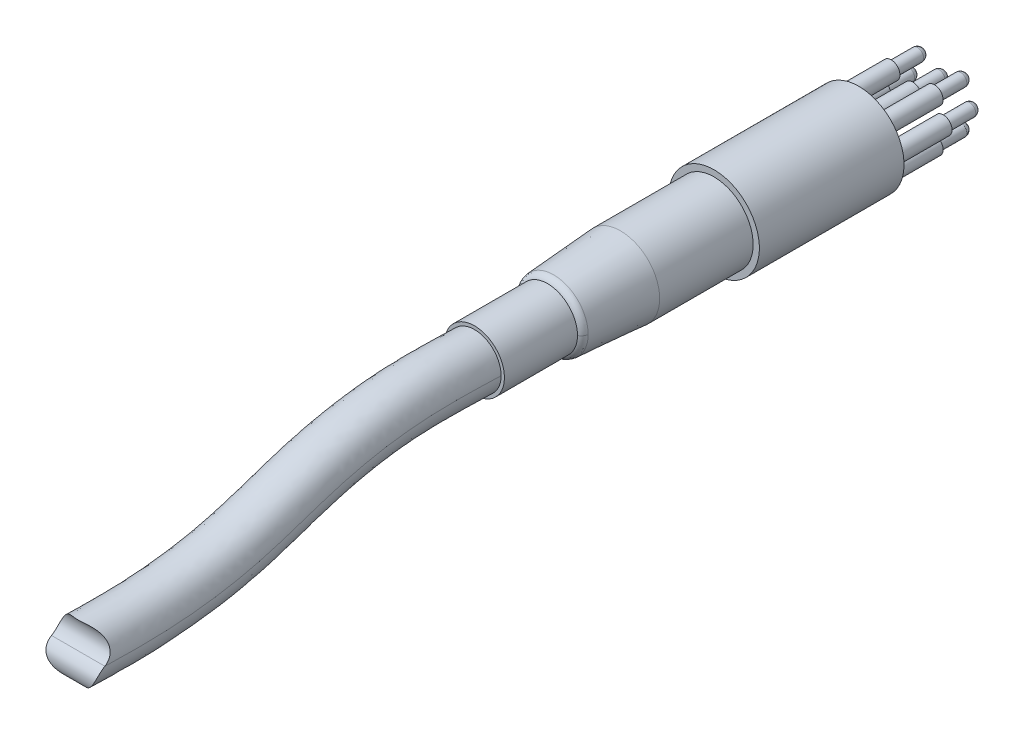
ISO-10303-21;
HEADER;
FILE_DESCRIPTION(('STEP AP214'),'2;1');
FILE_NAME('part.step','',(''),(''),'','','');
FILE_SCHEMA(('AUTOMOTIVE_DESIGN { 1 0 10303 214 1 1 1 1 }'));
ENDSEC;
DATA;
#1=APPLICATION_CONTEXT('core data for automotive mechanical design processes');
#2=APPLICATION_PROTOCOL_DEFINITION('international standard','automotive_design',2000,#1);
#3=PRODUCT_CONTEXT('',#1,'mechanical');
#4=PRODUCT('Part','Part','',(#3));
#5=PRODUCT_RELATED_PRODUCT_CATEGORY('part','',(#4));
#6=PRODUCT_DEFINITION_FORMATION('','',#4);
#7=PRODUCT_DEFINITION_CONTEXT('part definition',#1,'design');
#8=PRODUCT_DEFINITION('design','',#6,#7);
#9=PRODUCT_DEFINITION_SHAPE('','',#8);
#10=(LENGTH_UNIT() NAMED_UNIT(*) SI_UNIT(.MILLI.,.METRE.));
#11=(NAMED_UNIT(*) PLANE_ANGLE_UNIT() SI_UNIT($,.RADIAN.));
#12=(NAMED_UNIT(*) SI_UNIT($,.STERADIAN.) SOLID_ANGLE_UNIT());
#13=UNCERTAINTY_MEASURE_WITH_UNIT(LENGTH_MEASURE(1.E-05),#10,'distance_accuracy_value','');
#14=(GEOMETRIC_REPRESENTATION_CONTEXT(3) GLOBAL_UNCERTAINTY_ASSIGNED_CONTEXT((#13)) GLOBAL_UNIT_ASSIGNED_CONTEXT((#10,
#11,#12)) REPRESENTATION_CONTEXT('',''));
#15=CARTESIAN_POINT('',(0.,0.,0.));
#16=DIRECTION('',(0.,0.,1.));
#17=DIRECTION('',(1.,0.,0.));
#18=AXIS2_PLACEMENT_3D('',#15,#16,#17);
#19=CARTESIAN_POINT('',(3.75374705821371,-3.7537470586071,-13.9045156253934));
#20=DIRECTION('',(0.,-1.,0.));
#21=DIRECTION('',(0.,0.,-1.));
#22=AXIS2_PLACEMENT_3D('',#19,#20,#21);
#23=CIRCLE('',#22,1.081484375);
#24=TRIMMED_CURVE('',#23,(PARAMETER_VALUE(7.27030879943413E-10)),
(PARAMETER_VALUE(3.14159265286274)),.T.,.PARAMETER.);
#25=CARTESIAN_POINT('',(3.753747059,-3.753747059,-13.904515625));
#26=DIRECTION('',(0.,0.,1.));
#27=AXIS1_PLACEMENT('',#25,#26);
#28=SURFACE_OF_REVOLUTION('',#24,#27);
#29=CARTESIAN_POINT('',(3.75374706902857,-3.753747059,-14.9860000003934));
#30=VERTEX_POINT('',#29);
#31=VERTEX_LOOP('',#30);
#32=FACE_BOUND('',#31,.T.);
#33=CARTESIAN_POINT('',(3.753747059,-3.753747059,-13.97));
#34=DIRECTION('',(0.,0.,1.));
#35=DIRECTION('',(1.,0.,0.));
#36=AXIS2_PLACEMENT_3D('',#33,#34,#35);
#37=CIRCLE('',#36,1.0795);
#38=CARTESIAN_POINT('',(4.833247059,-3.753747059,-13.97));
#39=VERTEX_POINT('',#38);
#40=EDGE_CURVE('E88',#39,#39,#37,.F.);
#41=ORIENTED_EDGE('',*,*,#40,.T.);
#42=EDGE_LOOP('',(#41));
#43=FACE_BOUND('',#42,.T.);
#44=ADVANCED_FACE('F16',(#32,#43),#28,.T.);
#45=CARTESIAN_POINT('',(3.75374705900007,3.7537470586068,-13.9045156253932));
#46=DIRECTION('',(0.,0.,1.));
#47=DIRECTION('',(-1.,0.,0.));
#48=AXIS2_PLACEMENT_3D('',#45,#46,#47);
#49=SPHERICAL_SURFACE('',#48,1.081484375);
#50=CARTESIAN_POINT('',(3.75374706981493,3.753747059,-14.9860000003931));
#51=VERTEX_POINT('',#50);
#52=VERTEX_LOOP('',#51);
#53=FACE_BOUND('',#52,.T.);
#54=CARTESIAN_POINT('',(3.753747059,3.753747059,-13.97));
#55=DIRECTION('',(0.,0.,1.));
#56=DIRECTION('',(1.,0.,0.));
#57=AXIS2_PLACEMENT_3D('',#54,#55,#56);
#58=CIRCLE('',#57,1.0795);
#59=CARTESIAN_POINT('',(4.833247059,3.753747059,-13.97));
#60=VERTEX_POINT('',#59);
#61=EDGE_CURVE('E90',#60,#60,#58,.F.);
#62=ORIENTED_EDGE('',*,*,#61,.T.);
#63=EDGE_LOOP('',(#62));
#64=FACE_BOUND('',#63,.T.);
#65=ADVANCED_FACE('F84',(#53,#64),#49,.T.);
#66=CARTESIAN_POINT('',(-5.30860000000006,0.,-13.9045156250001));
#67=DIRECTION('',(0.,0.,1.));
#68=DIRECTION('',(-1.,0.,0.));
#69=AXIS2_PLACEMENT_3D('',#66,#67,#68);
#70=SPHERICAL_SURFACE('',#69,1.081484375);
#71=CARTESIAN_POINT('',(-5.30859998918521,0.,-14.9860000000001));
#72=VERTEX_POINT('',#71);
#73=VERTEX_LOOP('',#72);
#74=FACE_BOUND('',#73,.T.);
#75=CARTESIAN_POINT('',(-5.3086,0.,-13.97));
#76=DIRECTION('',(0.,0.,1.));
#77=DIRECTION('',(1.,0.,0.));
#78=AXIS2_PLACEMENT_3D('',#75,#76,#77);
#79=CIRCLE('',#78,1.0795);
#80=CARTESIAN_POINT('',(-4.2291,0.,-13.97));
#81=VERTEX_POINT('',#80);
#82=EDGE_CURVE('E93',#81,#81,#79,.F.);
#83=ORIENTED_EDGE('',*,*,#82,.T.);
#84=EDGE_LOOP('',(#83));
#85=FACE_BOUND('',#84,.T.);
#86=ADVANCED_FACE('F333',(#74,#85),#70,.T.);
#87=CARTESIAN_POINT('',(0.,-5.3086000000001,-13.9045156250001));
#88=DIRECTION('',(0.,0.,1.));
#89=DIRECTION('',(-1.,0.,0.));
#90=AXIS2_PLACEMENT_3D('',#87,#88,#89);
#91=SPHERICAL_SURFACE('',#90,1.081484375);
#92=CARTESIAN_POINT('',(1.08148686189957E-08,-5.3086,-14.9860000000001));
#93=VERTEX_POINT('',#92);
#94=VERTEX_LOOP('',#93);
#95=FACE_BOUND('',#94,.T.);
#96=CARTESIAN_POINT('',(0.,-5.3086,-13.97));
#97=DIRECTION('',(0.,0.,1.));
#98=DIRECTION('',(1.,0.,0.));
#99=AXIS2_PLACEMENT_3D('',#96,#97,#98);
#100=CIRCLE('',#99,1.0795);
#101=CARTESIAN_POINT('',(1.0795,-5.3086,-13.97));
#102=VERTEX_POINT('',#101);
#103=EDGE_CURVE('E326',#102,#102,#100,.F.);
#104=ORIENTED_EDGE('',*,*,#103,.T.);
#105=EDGE_LOOP('',(#104));
#106=FACE_BOUND('',#105,.T.);
#107=ADVANCED_FACE('F330',(#95,#106),#91,.T.);
#108=CARTESIAN_POINT('',(-3.75374705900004,-3.753747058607,-13.904515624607));
#109=DIRECTION('',(0.,0.,1.));
#110=DIRECTION('',(-1.,0.,0.));
#111=AXIS2_PLACEMENT_3D('',#108,#109,#110);
#112=SPHERICAL_SURFACE('',#111,1.081484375);
#113=CARTESIAN_POINT('',(-3.75374704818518,-3.753747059,-14.985999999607));
#114=VERTEX_POINT('',#113);
#115=VERTEX_LOOP('',#114);
#116=FACE_BOUND('',#115,.T.);
#117=CARTESIAN_POINT('',(-3.753747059,-3.753747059,-13.97));
#118=DIRECTION('',(0.,0.,1.));
#119=DIRECTION('',(1.,0.,0.));
#120=AXIS2_PLACEMENT_3D('',#117,#118,#119);
#121=CIRCLE('',#120,1.0795);
#122=CARTESIAN_POINT('',(-2.674247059,-3.753747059,-13.97));
#123=VERTEX_POINT('',#122);
#124=EDGE_CURVE('E321',#123,#123,#121,.F.);
#125=ORIENTED_EDGE('',*,*,#124,.T.);
#126=EDGE_LOOP('',(#125));
#127=FACE_BOUND('',#126,.T.);
#128=ADVANCED_FACE('F314',(#116,#127),#112,.T.);
#129=CARTESIAN_POINT('',(-3.75374705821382,3.753747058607,-13.9045156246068));
#130=DIRECTION('',(0.,0.,1.));
#131=DIRECTION('',(-1.,0.,0.));
#132=AXIS2_PLACEMENT_3D('',#129,#130,#131);
#133=SPHERICAL_SURFACE('',#132,1.081484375);
#134=CARTESIAN_POINT('',(-3.75374704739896,3.753747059,-14.9859999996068));
#135=VERTEX_POINT('',#134);
#136=VERTEX_LOOP('',#135);
#137=FACE_BOUND('',#136,.T.);
#138=CARTESIAN_POINT('',(-3.753747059,3.753747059,-13.97));
#139=DIRECTION('',(0.,0.,1.));
#140=DIRECTION('',(1.,0.,0.));
#141=AXIS2_PLACEMENT_3D('',#138,#139,#140);
#142=CIRCLE('',#141,1.0795);
#143=CARTESIAN_POINT('',(-2.674247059,3.753747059,-13.97));
#144=VERTEX_POINT('',#143);
#145=EDGE_CURVE('E295',#144,#144,#142,.F.);
#146=ORIENTED_EDGE('',*,*,#145,.T.);
#147=EDGE_LOOP('',(#146));
#148=FACE_BOUND('',#147,.T.);
#149=ADVANCED_FACE('F309',(#137,#148),#133,.T.);
#150=CARTESIAN_POINT('',(5.30860000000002,0.,-13.9045156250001));
#151=DIRECTION('',(0.,0.,1.));
#152=DIRECTION('',(-1.,0.,0.));
#153=AXIS2_PLACEMENT_3D('',#150,#151,#152);
#154=SPHERICAL_SURFACE('',#153,1.081484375);
#155=CARTESIAN_POINT('',(5.30860001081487,0.,-14.9860000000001));
#156=VERTEX_POINT('',#155);
#157=VERTEX_LOOP('',#156);
#158=FACE_BOUND('',#157,.T.);
#159=CARTESIAN_POINT('',(5.3086,0.,-13.97));
#160=DIRECTION('',(0.,0.,1.));
#161=DIRECTION('',(1.,0.,0.));
#162=AXIS2_PLACEMENT_3D('',#159,#160,#161);
#163=CIRCLE('',#162,1.0795);
#164=CARTESIAN_POINT('',(6.3881,0.,-13.97));
#165=VERTEX_POINT('',#164);
#166=EDGE_CURVE('E290',#165,#165,#163,.F.);
#167=ORIENTED_EDGE('',*,*,#166,.T.);
#168=EDGE_LOOP('',(#167));
#169=FACE_BOUND('',#168,.T.);
#170=ADVANCED_FACE('F304',(#158,#169),#154,.T.);
#171=CARTESIAN_POINT('',(0.,2.2860000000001,-13.9045156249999));
#172=DIRECTION('',(0.,0.,1.));
#173=DIRECTION('',(-1.,0.,0.));
#174=AXIS2_PLACEMENT_3D('',#171,#172,#173);
#175=SPHERICAL_SURFACE('',#174,1.081484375);
#176=CARTESIAN_POINT('',(1.08148486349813E-08,2.286,-14.9859999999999));
#177=VERTEX_POINT('',#176);
#178=VERTEX_LOOP('',#177);
#179=FACE_BOUND('',#178,.T.);
#180=CARTESIAN_POINT('',(0.,2.286,-13.97));
#181=DIRECTION('',(0.,0.,1.));
#182=DIRECTION('',(1.,0.,0.));
#183=AXIS2_PLACEMENT_3D('',#180,#181,#182);
#184=CIRCLE('',#183,1.0795);
#185=CARTESIAN_POINT('',(1.0795,2.286,-13.97));
#186=VERTEX_POINT('',#185);
#187=EDGE_CURVE('E286',#186,#186,#184,.F.);
#188=ORIENTED_EDGE('',*,*,#187,.T.);
#189=EDGE_LOOP('',(#188));
#190=FACE_BOUND('',#189,.T.);
#191=ADVANCED_FACE('F308',(#179,#190),#175,.T.);
#192=CARTESIAN_POINT('',(3.753747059,-3.753747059,-13.97));
#193=DIRECTION('',(0.,0.,1.));
#194=DIRECTION('',(0.,-1.,0.));
#195=AXIS2_PLACEMENT_3D('',#192,#193,#194);
#196=CYLINDRICAL_SURFACE('',#195,1.0795);
#197=CARTESIAN_POINT('',(3.753747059,-3.753747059,-9.398));
#198=DIRECTION('',(0.,0.,1.));
#199=DIRECTION('',(0.,-1.,0.));
#200=AXIS2_PLACEMENT_3D('',#197,#198,#199);
#201=CIRCLE('',#200,1.0795);
#202=CARTESIAN_POINT('',(3.753747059,-4.833247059,-9.398));
#203=VERTEX_POINT('',#202);
#204=EDGE_CURVE('E284',#203,#203,#201,.T.);
#205=ORIENTED_EDGE('',*,*,#204,.F.);
#206=EDGE_LOOP('',(#205));
#207=FACE_BOUND('',#206,.T.);
#208=ORIENTED_EDGE('',*,*,#40,.F.);
#209=EDGE_LOOP('',(#208));
#210=FACE_BOUND('',#209,.T.);
#211=ADVANCED_FACE('F672',(#207,#210),#196,.T.);
#212=CARTESIAN_POINT('',(3.753747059,3.753747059,-13.97));
#213=DIRECTION('',(0.,0.,1.));
#214=DIRECTION('',(0.,-1.,0.));
#215=AXIS2_PLACEMENT_3D('',#212,#213,#214);
#216=CYLINDRICAL_SURFACE('',#215,1.0795);
#217=CARTESIAN_POINT('',(3.753747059,3.753747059,-9.398));
#218=DIRECTION('',(0.,0.,1.));
#219=DIRECTION('',(0.,-1.,0.));
#220=AXIS2_PLACEMENT_3D('',#217,#218,#219);
#221=CIRCLE('',#220,1.0795);
#222=CARTESIAN_POINT('',(3.753747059,2.674247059,-9.398));
#223=VERTEX_POINT('',#222);
#224=EDGE_CURVE('E281',#223,#223,#221,.T.);
#225=ORIENTED_EDGE('',*,*,#224,.F.);
#226=EDGE_LOOP('',(#225));
#227=FACE_BOUND('',#226,.T.);
#228=ORIENTED_EDGE('',*,*,#61,.F.);
#229=EDGE_LOOP('',(#228));
#230=FACE_BOUND('',#229,.T.);
#231=ADVANCED_FACE('F363',(#227,#230),#216,.T.);
#232=CARTESIAN_POINT('',(-5.3086,0.,-13.97));
#233=DIRECTION('',(0.,0.,1.));
#234=DIRECTION('',(0.,-1.,0.));
#235=AXIS2_PLACEMENT_3D('',#232,#233,#234);
#236=CYLINDRICAL_SURFACE('',#235,1.0795);
#237=CARTESIAN_POINT('',(-5.3086,0.,-9.398));
#238=DIRECTION('',(0.,0.,1.));
#239=DIRECTION('',(0.,-1.,0.));
#240=AXIS2_PLACEMENT_3D('',#237,#238,#239);
#241=CIRCLE('',#240,1.0795);
#242=CARTESIAN_POINT('',(-5.3086,-1.0795,-9.398));
#243=VERTEX_POINT('',#242);
#244=EDGE_CURVE('E278',#243,#243,#241,.T.);
#245=ORIENTED_EDGE('',*,*,#244,.F.);
#246=EDGE_LOOP('',(#245));
#247=FACE_BOUND('',#246,.T.);
#248=ORIENTED_EDGE('',*,*,#82,.F.);
#249=EDGE_LOOP('',(#248));
#250=FACE_BOUND('',#249,.T.);
#251=ADVANCED_FACE('F352',(#247,#250),#236,.T.);
#252=CARTESIAN_POINT('',(0.,-5.3086,-13.97));
#253=DIRECTION('',(0.,0.,1.));
#254=DIRECTION('',(0.,-1.,0.));
#255=AXIS2_PLACEMENT_3D('',#252,#253,#254);
#256=CYLINDRICAL_SURFACE('',#255,1.0795);
#257=CARTESIAN_POINT('',(0.,-5.3086,-9.398));
#258=DIRECTION('',(0.,0.,1.));
#259=DIRECTION('',(0.,-1.,0.));
#260=AXIS2_PLACEMENT_3D('',#257,#258,#259);
#261=CIRCLE('',#260,1.0795);
#262=CARTESIAN_POINT('',(0.,-6.3881,-9.398));
#263=VERTEX_POINT('',#262);
#264=EDGE_CURVE('E275',#263,#263,#261,.T.);
#265=ORIENTED_EDGE('',*,*,#264,.F.);
#266=EDGE_LOOP('',(#265));
#267=FACE_BOUND('',#266,.T.);
#268=ORIENTED_EDGE('',*,*,#103,.F.);
#269=EDGE_LOOP('',(#268));
#270=FACE_BOUND('',#269,.T.);
#271=ADVANCED_FACE('F349',(#267,#270),#256,.T.);
#272=CARTESIAN_POINT('',(-3.753747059,-3.753747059,-13.97));
#273=DIRECTION('',(0.,0.,1.));
#274=DIRECTION('',(0.,-1.,0.));
#275=AXIS2_PLACEMENT_3D('',#272,#273,#274);
#276=CYLINDRICAL_SURFACE('',#275,1.0795);
#277=CARTESIAN_POINT('',(-3.753747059,-3.753747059,-9.398));
#278=DIRECTION('',(0.,0.,1.));
#279=DIRECTION('',(0.,-1.,0.));
#280=AXIS2_PLACEMENT_3D('',#277,#278,#279);
#281=CIRCLE('',#280,1.0795);
#282=CARTESIAN_POINT('',(-3.753747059,-4.833247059,-9.398));
#283=VERTEX_POINT('',#282);
#284=EDGE_CURVE('E272',#283,#283,#281,.T.);
#285=ORIENTED_EDGE('',*,*,#284,.F.);
#286=EDGE_LOOP('',(#285));
#287=FACE_BOUND('',#286,.T.);
#288=ORIENTED_EDGE('',*,*,#124,.F.);
#289=EDGE_LOOP('',(#288));
#290=FACE_BOUND('',#289,.T.);
#291=ADVANCED_FACE('F351',(#287,#290),#276,.T.);
#292=CARTESIAN_POINT('',(-3.753747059,3.753747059,-13.97));
#293=DIRECTION('',(0.,0.,1.));
#294=DIRECTION('',(0.,-1.,0.));
#295=AXIS2_PLACEMENT_3D('',#292,#293,#294);
#296=CYLINDRICAL_SURFACE('',#295,1.0795);
#297=CARTESIAN_POINT('',(-3.753747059,3.753747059,-9.398));
#298=DIRECTION('',(0.,0.,1.));
#299=DIRECTION('',(0.,-1.,0.));
#300=AXIS2_PLACEMENT_3D('',#297,#298,#299);
#301=CIRCLE('',#300,1.0795);
#302=CARTESIAN_POINT('',(-3.753747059,2.674247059,-9.398));
#303=VERTEX_POINT('',#302);
#304=EDGE_CURVE('E269',#303,#303,#301,.T.);
#305=ORIENTED_EDGE('',*,*,#304,.F.);
#306=EDGE_LOOP('',(#305));
#307=FACE_BOUND('',#306,.T.);
#308=ORIENTED_EDGE('',*,*,#145,.F.);
#309=EDGE_LOOP('',(#308));
#310=FACE_BOUND('',#309,.T.);
#311=ADVANCED_FACE('F360',(#307,#310),#296,.T.);
#312=CARTESIAN_POINT('',(5.3086,0.,-13.97));
#313=DIRECTION('',(0.,0.,1.));
#314=DIRECTION('',(0.,-1.,0.));
#315=AXIS2_PLACEMENT_3D('',#312,#313,#314);
#316=CYLINDRICAL_SURFACE('',#315,1.0795);
#317=CARTESIAN_POINT('',(5.3086,0.,-9.398));
#318=DIRECTION('',(0.,0.,1.));
#319=DIRECTION('',(0.,-1.,0.));
#320=AXIS2_PLACEMENT_3D('',#317,#318,#319);
#321=CIRCLE('',#320,1.0795);
#322=CARTESIAN_POINT('',(5.3086,-1.0795,-9.398));
#323=VERTEX_POINT('',#322);
#324=EDGE_CURVE('E266',#323,#323,#321,.T.);
#325=ORIENTED_EDGE('',*,*,#324,.F.);
#326=EDGE_LOOP('',(#325));
#327=FACE_BOUND('',#326,.T.);
#328=ORIENTED_EDGE('',*,*,#166,.F.);
#329=EDGE_LOOP('',(#328));
#330=FACE_BOUND('',#329,.T.);
#331=ADVANCED_FACE('F627',(#327,#330),#316,.T.);
#332=CARTESIAN_POINT('',(0.,2.286,-13.97));
#333=DIRECTION('',(0.,0.,1.));
#334=DIRECTION('',(0.,-1.,0.));
#335=AXIS2_PLACEMENT_3D('',#332,#333,#334);
#336=CYLINDRICAL_SURFACE('',#335,1.0795);
#337=CARTESIAN_POINT('',(0.,2.286,-9.398));
#338=DIRECTION('',(0.,0.,1.));
#339=DIRECTION('',(0.,-1.,0.));
#340=AXIS2_PLACEMENT_3D('',#337,#338,#339);
#341=CIRCLE('',#340,1.0795);
#342=CARTESIAN_POINT('',(0.,1.2065,-9.398));
#343=VERTEX_POINT('',#342);
#344=EDGE_CURVE('E263',#343,#343,#341,.T.);
#345=ORIENTED_EDGE('',*,*,#344,.F.);
#346=EDGE_LOOP('',(#345));
#347=FACE_BOUND('',#346,.T.);
#348=ORIENTED_EDGE('',*,*,#187,.F.);
#349=EDGE_LOOP('',(#348));
#350=FACE_BOUND('',#349,.T.);
#351=ADVANCED_FACE('F618',(#347,#350),#336,.T.);
#352=CARTESIAN_POINT('',(5.934871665,-3.753747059,-9.398));
#353=DIRECTION('',(0.,0.,-1.));
#354=DIRECTION('',(-0.707106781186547,-0.707106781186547,0.));
#355=AXIS2_PLACEMENT_3D('',#352,#353,#354);
#356=PLANE('',#355);
#357=ORIENTED_EDGE('',*,*,#204,.T.);
#358=EDGE_LOOP('',(#357));
#359=FACE_BOUND('',#358,.T.);
#360=CARTESIAN_POINT('',(3.753747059,-3.753747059,-9.398));
#361=DIRECTION('',(0.,0.,1.));
#362=DIRECTION('',(1.,0.,0.));
#363=AXIS2_PLACEMENT_3D('',#360,#361,#362);
#364=CIRCLE('',#363,1.524);
#365=CARTESIAN_POINT('',(5.277747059,-3.753747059,-9.398));
#366=VERTEX_POINT('',#365);
#367=EDGE_CURVE('E260',#366,#366,#364,.F.);
#368=ORIENTED_EDGE('',*,*,#367,.T.);
#369=EDGE_LOOP('',(#368));
#370=FACE_BOUND('',#369,.T.);
#371=ADVANCED_FACE('F609',(#359,#370),#356,.T.);
#372=CARTESIAN_POINT('',(3.753747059,5.934871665,-9.398));
#373=DIRECTION('',(0.,0.,-1.));
#374=DIRECTION('',(0.707106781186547,-0.707106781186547,0.));
#375=AXIS2_PLACEMENT_3D('',#372,#373,#374);
#376=PLANE('',#375);
#377=ORIENTED_EDGE('',*,*,#224,.T.);
#378=EDGE_LOOP('',(#377));
#379=FACE_BOUND('',#378,.T.);
#380=CARTESIAN_POINT('',(3.753747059,3.753747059,-9.398));
#381=DIRECTION('',(0.,0.,1.));
#382=DIRECTION('',(1.,0.,0.));
#383=AXIS2_PLACEMENT_3D('',#380,#381,#382);
#384=CIRCLE('',#383,1.524);
#385=CARTESIAN_POINT('',(5.277747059,3.753747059,-9.398));
#386=VERTEX_POINT('',#385);
#387=EDGE_CURVE('E257',#386,#386,#384,.F.);
#388=ORIENTED_EDGE('',*,*,#387,.T.);
#389=EDGE_LOOP('',(#388));
#390=FACE_BOUND('',#389,.T.);
#391=ADVANCED_FACE('F600',(#379,#390),#376,.T.);
#392=CARTESIAN_POINT('',(-6.850888,-1.542288,-9.398));
#393=DIRECTION('',(0.,0.,-1.));
#394=DIRECTION('',(0.,1.,0.));
#395=AXIS2_PLACEMENT_3D('',#392,#393,#394);
#396=PLANE('',#395);
#397=ORIENTED_EDGE('',*,*,#244,.T.);
#398=EDGE_LOOP('',(#397));
#399=FACE_BOUND('',#398,.T.);
#400=CARTESIAN_POINT('',(-5.3086,0.,-9.398));
#401=DIRECTION('',(0.,0.,1.));
#402=DIRECTION('',(1.,0.,0.));
#403=AXIS2_PLACEMENT_3D('',#400,#401,#402);
#404=CIRCLE('',#403,1.524);
#405=CARTESIAN_POINT('',(-3.7846,0.,-9.398));
#406=VERTEX_POINT('',#405);
#407=EDGE_CURVE('E254',#406,#406,#404,.F.);
#408=ORIENTED_EDGE('',*,*,#407,.T.);
#409=EDGE_LOOP('',(#408));
#410=FACE_BOUND('',#409,.T.);
#411=ADVANCED_FACE('F591',(#399,#410),#396,.T.);
#412=CARTESIAN_POINT('',(1.542288,-6.850888,-9.398));
#413=DIRECTION('',(0.,0.,-1.));
#414=DIRECTION('',(-1.,0.,0.));
#415=AXIS2_PLACEMENT_3D('',#412,#413,#414);
#416=PLANE('',#415);
#417=ORIENTED_EDGE('',*,*,#264,.T.);
#418=EDGE_LOOP('',(#417));
#419=FACE_BOUND('',#418,.T.);
#420=CARTESIAN_POINT('',(0.,-5.3086,-9.398));
#421=DIRECTION('',(0.,0.,1.));
#422=DIRECTION('',(1.,0.,0.));
#423=AXIS2_PLACEMENT_3D('',#420,#421,#422);
#424=CIRCLE('',#423,1.524);
#425=CARTESIAN_POINT('',(1.524,-5.3086,-9.398));
#426=VERTEX_POINT('',#425);
#427=EDGE_CURVE('E251',#426,#426,#424,.F.);
#428=ORIENTED_EDGE('',*,*,#427,.T.);
#429=EDGE_LOOP('',(#428));
#430=FACE_BOUND('',#429,.T.);
#431=ADVANCED_FACE('F582',(#419,#430),#416,.T.);
#432=CARTESIAN_POINT('',(-3.753747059,-5.934871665,-9.398));
#433=DIRECTION('',(0.,0.,-1.));
#434=DIRECTION('',(-0.707106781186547,0.707106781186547,0.));
#435=AXIS2_PLACEMENT_3D('',#432,#433,#434);
#436=PLANE('',#435);
#437=ORIENTED_EDGE('',*,*,#284,.T.);
#438=EDGE_LOOP('',(#437));
#439=FACE_BOUND('',#438,.T.);
#440=CARTESIAN_POINT('',(-3.753747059,-3.753747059,-9.398));
#441=DIRECTION('',(0.,0.,1.));
#442=DIRECTION('',(1.,0.,0.));
#443=AXIS2_PLACEMENT_3D('',#440,#441,#442);
#444=CIRCLE('',#443,1.524);
#445=CARTESIAN_POINT('',(-2.229747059,-3.753747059,-9.398));
#446=VERTEX_POINT('',#445);
#447=EDGE_CURVE('E248',#446,#446,#444,.F.);
#448=ORIENTED_EDGE('',*,*,#447,.T.);
#449=EDGE_LOOP('',(#448));
#450=FACE_BOUND('',#449,.T.);
#451=ADVANCED_FACE('F573',(#439,#450),#436,.T.);
#452=CARTESIAN_POINT('',(-5.934871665,3.753747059,-9.398));
#453=DIRECTION('',(0.,0.,-1.));
#454=DIRECTION('',(0.707106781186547,0.707106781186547,0.));
#455=AXIS2_PLACEMENT_3D('',#452,#453,#454);
#456=PLANE('',#455);
#457=ORIENTED_EDGE('',*,*,#304,.T.);
#458=EDGE_LOOP('',(#457));
#459=FACE_BOUND('',#458,.T.);
#460=CARTESIAN_POINT('',(-3.753747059,3.753747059,-9.398));
#461=DIRECTION('',(0.,0.,1.));
#462=DIRECTION('',(1.,0.,0.));
#463=AXIS2_PLACEMENT_3D('',#460,#461,#462);
#464=CIRCLE('',#463,1.524);
#465=CARTESIAN_POINT('',(-2.229747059,3.753747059,-9.398));
#466=VERTEX_POINT('',#465);
#467=EDGE_CURVE('E245',#466,#466,#464,.F.);
#468=ORIENTED_EDGE('',*,*,#467,.T.);
#469=EDGE_LOOP('',(#468));
#470=FACE_BOUND('',#469,.T.);
#471=ADVANCED_FACE('F564',(#459,#470),#456,.T.);
#472=CARTESIAN_POINT('',(6.850888,1.542288,-9.398));
#473=DIRECTION('',(0.,0.,-1.));
#474=DIRECTION('',(0.,-1.,0.));
#475=AXIS2_PLACEMENT_3D('',#472,#473,#474);
#476=PLANE('',#475);
#477=ORIENTED_EDGE('',*,*,#324,.T.);
#478=EDGE_LOOP('',(#477));
#479=FACE_BOUND('',#478,.T.);
#480=CARTESIAN_POINT('',(5.3086,0.,-9.398));
#481=DIRECTION('',(0.,0.,1.));
#482=DIRECTION('',(1.,0.,0.));
#483=AXIS2_PLACEMENT_3D('',#480,#481,#482);
#484=CIRCLE('',#483,1.524);
#485=CARTESIAN_POINT('',(6.8326,0.,-9.398));
#486=VERTEX_POINT('',#485);
#487=EDGE_CURVE('E242',#486,#486,#484,.F.);
#488=ORIENTED_EDGE('',*,*,#487,.T.);
#489=EDGE_LOOP('',(#488));
#490=FACE_BOUND('',#489,.T.);
#491=ADVANCED_FACE('F555',(#479,#490),#476,.T.);
#492=CARTESIAN_POINT('',(1.542288,0.743712,-9.398));
#493=DIRECTION('',(0.,0.,-1.));
#494=DIRECTION('',(-1.,0.,0.));
#495=AXIS2_PLACEMENT_3D('',#492,#493,#494);
#496=PLANE('',#495);
#497=ORIENTED_EDGE('',*,*,#344,.T.);
#498=EDGE_LOOP('',(#497));
#499=FACE_BOUND('',#498,.T.);
#500=CARTESIAN_POINT('',(0.,2.286,-9.398));
#501=DIRECTION('',(0.,0.,1.));
#502=DIRECTION('',(1.,0.,0.));
#503=AXIS2_PLACEMENT_3D('',#500,#501,#502);
#504=CIRCLE('',#503,1.524);
#505=CARTESIAN_POINT('',(1.524,2.286,-9.398));
#506=VERTEX_POINT('',#505);
#507=EDGE_CURVE('E239',#506,#506,#504,.F.);
#508=ORIENTED_EDGE('',*,*,#507,.T.);
#509=EDGE_LOOP('',(#508));
#510=FACE_BOUND('',#509,.T.);
#511=ADVANCED_FACE('F546',(#499,#510),#496,.T.);
#512=CARTESIAN_POINT('',(3.753747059,-3.753747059,-9.398));
#513=DIRECTION('',(0.,0.,1.));
#514=DIRECTION('',(1.,0.,0.));
#515=AXIS2_PLACEMENT_3D('',#512,#513,#514);
#516=CYLINDRICAL_SURFACE('',#515,1.524);
#517=ORIENTED_EDGE('',*,*,#367,.F.);
#518=EDGE_LOOP('',(#517));
#519=FACE_BOUND('',#518,.T.);
#520=CARTESIAN_POINT('',(3.753747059,-3.753747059,0.));
#521=DIRECTION('',(0.,0.,1.));
#522=DIRECTION('',(1.,0.,0.));
#523=AXIS2_PLACEMENT_3D('',#520,#521,#522);
#524=CIRCLE('',#523,1.524);
#525=CARTESIAN_POINT('',(5.277747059,-3.753747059,0.));
#526=VERTEX_POINT('',#525);
#527=EDGE_CURVE('E236',#526,#526,#524,.F.);
#528=ORIENTED_EDGE('',*,*,#527,.T.);
#529=EDGE_LOOP('',(#528));
#530=FACE_BOUND('',#529,.T.);
#531=ADVANCED_FACE('F537',(#519,#530),#516,.T.);
#532=CARTESIAN_POINT('',(3.753747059,3.753747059,-9.398));
#533=DIRECTION('',(0.,0.,1.));
#534=DIRECTION('',(1.,0.,0.));
#535=AXIS2_PLACEMENT_3D('',#532,#533,#534);
#536=CYLINDRICAL_SURFACE('',#535,1.524);
#537=ORIENTED_EDGE('',*,*,#387,.F.);
#538=EDGE_LOOP('',(#537));
#539=FACE_BOUND('',#538,.T.);
#540=CARTESIAN_POINT('',(3.753747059,3.753747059,0.));
#541=DIRECTION('',(0.,0.,1.));
#542=DIRECTION('',(1.,0.,0.));
#543=AXIS2_PLACEMENT_3D('',#540,#541,#542);
#544=CIRCLE('',#543,1.524);
#545=CARTESIAN_POINT('',(5.277747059,3.753747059,0.));
#546=VERTEX_POINT('',#545);
#547=EDGE_CURVE('E233',#546,#546,#544,.F.);
#548=ORIENTED_EDGE('',*,*,#547,.T.);
#549=EDGE_LOOP('',(#548));
#550=FACE_BOUND('',#549,.T.);
#551=ADVANCED_FACE('F528',(#539,#550),#536,.T.);
#552=CARTESIAN_POINT('',(-5.3086,0.,-9.398));
#553=DIRECTION('',(0.,0.,1.));
#554=DIRECTION('',(1.,0.,0.));
#555=AXIS2_PLACEMENT_3D('',#552,#553,#554);
#556=CYLINDRICAL_SURFACE('',#555,1.524);
#557=ORIENTED_EDGE('',*,*,#407,.F.);
#558=EDGE_LOOP('',(#557));
#559=FACE_BOUND('',#558,.T.);
#560=CARTESIAN_POINT('',(-5.3086,0.,0.));
#561=DIRECTION('',(0.,0.,1.));
#562=DIRECTION('',(1.,0.,0.));
#563=AXIS2_PLACEMENT_3D('',#560,#561,#562);
#564=CIRCLE('',#563,1.524);
#565=CARTESIAN_POINT('',(-3.7846,0.,0.));
#566=VERTEX_POINT('',#565);
#567=EDGE_CURVE('E230',#566,#566,#564,.F.);
#568=ORIENTED_EDGE('',*,*,#567,.T.);
#569=EDGE_LOOP('',(#568));
#570=FACE_BOUND('',#569,.T.);
#571=ADVANCED_FACE('F519',(#559,#570),#556,.T.);
#572=CARTESIAN_POINT('',(0.,-5.3086,-9.398));
#573=DIRECTION('',(0.,0.,1.));
#574=DIRECTION('',(1.,0.,0.));
#575=AXIS2_PLACEMENT_3D('',#572,#573,#574);
#576=CYLINDRICAL_SURFACE('',#575,1.524);
#577=ORIENTED_EDGE('',*,*,#427,.F.);
#578=EDGE_LOOP('',(#577));
#579=FACE_BOUND('',#578,.T.);
#580=CARTESIAN_POINT('',(0.,-5.3086,0.));
#581=DIRECTION('',(0.,0.,1.));
#582=DIRECTION('',(1.,0.,0.));
#583=AXIS2_PLACEMENT_3D('',#580,#581,#582);
#584=CIRCLE('',#583,1.524);
#585=CARTESIAN_POINT('',(1.524,-5.3086,0.));
#586=VERTEX_POINT('',#585);
#587=EDGE_CURVE('E227',#586,#586,#584,.F.);
#588=ORIENTED_EDGE('',*,*,#587,.T.);
#589=EDGE_LOOP('',(#588));
#590=FACE_BOUND('',#589,.T.);
#591=ADVANCED_FACE('F510',(#579,#590),#576,.T.);
#592=CARTESIAN_POINT('',(-3.753747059,-3.753747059,-9.398));
#593=DIRECTION('',(0.,0.,1.));
#594=DIRECTION('',(1.,0.,0.));
#595=AXIS2_PLACEMENT_3D('',#592,#593,#594);
#596=CYLINDRICAL_SURFACE('',#595,1.524);
#597=ORIENTED_EDGE('',*,*,#447,.F.);
#598=EDGE_LOOP('',(#597));
#599=FACE_BOUND('',#598,.T.);
#600=CARTESIAN_POINT('',(-3.753747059,-3.753747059,0.));
#601=DIRECTION('',(0.,0.,1.));
#602=DIRECTION('',(1.,0.,0.));
#603=AXIS2_PLACEMENT_3D('',#600,#601,#602);
#604=CIRCLE('',#603,1.524);
#605=CARTESIAN_POINT('',(-2.229747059,-3.753747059,0.));
#606=VERTEX_POINT('',#605);
#607=EDGE_CURVE('E224',#606,#606,#604,.F.);
#608=ORIENTED_EDGE('',*,*,#607,.T.);
#609=EDGE_LOOP('',(#608));
#610=FACE_BOUND('',#609,.T.);
#611=ADVANCED_FACE('F501',(#599,#610),#596,.T.);
#612=CARTESIAN_POINT('',(-3.753747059,3.753747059,-9.398));
#613=DIRECTION('',(0.,0.,1.));
#614=DIRECTION('',(1.,0.,0.));
#615=AXIS2_PLACEMENT_3D('',#612,#613,#614);
#616=CYLINDRICAL_SURFACE('',#615,1.524);
#617=ORIENTED_EDGE('',*,*,#467,.F.);
#618=EDGE_LOOP('',(#617));
#619=FACE_BOUND('',#618,.T.);
#620=CARTESIAN_POINT('',(-3.753747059,3.753747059,0.));
#621=DIRECTION('',(0.,0.,1.));
#622=DIRECTION('',(1.,0.,0.));
#623=AXIS2_PLACEMENT_3D('',#620,#621,#622);
#624=CIRCLE('',#623,1.524);
#625=CARTESIAN_POINT('',(-2.229747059,3.753747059,0.));
#626=VERTEX_POINT('',#625);
#627=EDGE_CURVE('E221',#626,#626,#624,.F.);
#628=ORIENTED_EDGE('',*,*,#627,.T.);
#629=EDGE_LOOP('',(#628));
#630=FACE_BOUND('',#629,.T.);
#631=ADVANCED_FACE('F492',(#619,#630),#616,.T.);
#632=CARTESIAN_POINT('',(5.3086,0.,-9.398));
#633=DIRECTION('',(0.,0.,1.));
#634=DIRECTION('',(1.,0.,0.));
#635=AXIS2_PLACEMENT_3D('',#632,#633,#634);
#636=CYLINDRICAL_SURFACE('',#635,1.524);
#637=ORIENTED_EDGE('',*,*,#487,.F.);
#638=EDGE_LOOP('',(#637));
#639=FACE_BOUND('',#638,.T.);
#640=CARTESIAN_POINT('',(5.3086,0.,0.));
#641=DIRECTION('',(0.,0.,1.));
#642=DIRECTION('',(1.,0.,0.));
#643=AXIS2_PLACEMENT_3D('',#640,#641,#642);
#644=CIRCLE('',#643,1.524);
#645=CARTESIAN_POINT('',(6.8326,0.,0.));
#646=VERTEX_POINT('',#645);
#647=EDGE_CURVE('E218',#646,#646,#644,.F.);
#648=ORIENTED_EDGE('',*,*,#647,.T.);
#649=EDGE_LOOP('',(#648));
#650=FACE_BOUND('',#649,.T.);
#651=ADVANCED_FACE('F483',(#639,#650),#636,.T.);
#652=CARTESIAN_POINT('',(0.,2.286,-9.398));
#653=DIRECTION('',(0.,0.,1.));
#654=DIRECTION('',(1.,0.,0.));
#655=AXIS2_PLACEMENT_3D('',#652,#653,#654);
#656=CYLINDRICAL_SURFACE('',#655,1.524);
#657=ORIENTED_EDGE('',*,*,#507,.F.);
#658=EDGE_LOOP('',(#657));
#659=FACE_BOUND('',#658,.T.);
#660=CARTESIAN_POINT('',(0.,2.286,0.));
#661=DIRECTION('',(0.,0.,1.));
#662=DIRECTION('',(1.,0.,0.));
#663=AXIS2_PLACEMENT_3D('',#660,#661,#662);
#664=CIRCLE('',#663,1.524);
#665=CARTESIAN_POINT('',(1.524,2.286,0.));
#666=VERTEX_POINT('',#665);
#667=EDGE_CURVE('E215',#666,#666,#664,.F.);
#668=ORIENTED_EDGE('',*,*,#667,.T.);
#669=EDGE_LOOP('',(#668));
#670=FACE_BOUND('',#669,.T.);
#671=ADVANCED_FACE('F474',(#659,#670),#656,.T.);
#672=CARTESIAN_POINT('',(-7.968488,-7.968488,0.));
#673=DIRECTION('',(0.,0.,1.));
#674=DIRECTION('',(1.,0.,0.));
#675=AXIS2_PLACEMENT_3D('',#672,#673,#674);
#676=PLANE('',#675);
#677=ORIENTED_EDGE('',*,*,#667,.F.);
#678=EDGE_LOOP('',(#677));
#679=FACE_BOUND('',#678,.T.);
#680=ORIENTED_EDGE('',*,*,#647,.F.);
#681=EDGE_LOOP('',(#680));
#682=FACE_BOUND('',#681,.T.);
#683=ORIENTED_EDGE('',*,*,#627,.F.);
#684=EDGE_LOOP('',(#683));
#685=FACE_BOUND('',#684,.T.);
#686=ORIENTED_EDGE('',*,*,#607,.F.);
#687=EDGE_LOOP('',(#686));
#688=FACE_BOUND('',#687,.T.);
#689=ORIENTED_EDGE('',*,*,#587,.F.);
#690=EDGE_LOOP('',(#689));
#691=FACE_BOUND('',#690,.T.);
#692=ORIENTED_EDGE('',*,*,#567,.F.);
#693=EDGE_LOOP('',(#692));
#694=FACE_BOUND('',#693,.T.);
#695=ORIENTED_EDGE('',*,*,#547,.F.);
#696=EDGE_LOOP('',(#695));
#697=FACE_BOUND('',#696,.T.);
#698=ORIENTED_EDGE('',*,*,#527,.F.);
#699=EDGE_LOOP('',(#698));
#700=FACE_BOUND('',#699,.T.);
#701=CARTESIAN_POINT('',(0.,0.,0.));
#702=DIRECTION('',(0.,0.,-1.));
#703=DIRECTION('',(-1.,0.,0.));
#704=AXIS2_PLACEMENT_3D('',#701,#702,#703);
#705=CIRCLE('',#704,7.874);
#706=CARTESIAN_POINT('',(-7.874,0.,0.));
#707=VERTEX_POINT('',#706);
#708=EDGE_CURVE('E212',#707,#707,#705,.T.);
#709=ORIENTED_EDGE('',*,*,#708,.T.);
#710=EDGE_LOOP('',(#709));
#711=FACE_BOUND('',#710,.T.);
#712=ADVANCED_FACE('F465',(#679,#682,#685,#688,#691,#694,#697,#700,#711),#676,.F.);
#713=CARTESIAN_POINT('',(0.,0.,25.146));
#714=DIRECTION('',(0.,0.,-1.));
#715=DIRECTION('',(-1.,0.,0.));
#716=AXIS2_PLACEMENT_3D('',#713,#714,#715);
#717=CYLINDRICAL_SURFACE('',#716,7.874);
#718=ORIENTED_EDGE('',*,*,#708,.F.);
#719=EDGE_LOOP('',(#718));
#720=FACE_BOUND('',#719,.T.);
#721=CARTESIAN_POINT('',(0.,0.,25.146));
#722=DIRECTION('',(0.,0.,-1.));
#723=DIRECTION('',(-1.,0.,0.));
#724=AXIS2_PLACEMENT_3D('',#721,#722,#723);
#725=CIRCLE('',#724,7.874);
#726=CARTESIAN_POINT('',(-7.874,0.,25.146));
#727=VERTEX_POINT('',#726);
#728=EDGE_CURVE('E209',#727,#727,#725,.F.);
#729=ORIENTED_EDGE('',*,*,#728,.F.);
#730=EDGE_LOOP('',(#729));
#731=FACE_BOUND('',#730,.T.);
#732=ADVANCED_FACE('F457',(#720,#731),#717,.T.);
#733=CARTESIAN_POINT('',(-7.968488,-7.968488,25.146));
#734=DIRECTION('',(0.,0.,1.));
#735=DIRECTION('',(1.,0.,0.));
#736=AXIS2_PLACEMENT_3D('',#733,#734,#735);
#737=PLANE('',#736);
#738=CARTESIAN_POINT('',(0.,0.,25.146));
#739=DIRECTION('',(0.,0.,-1.));
#740=DIRECTION('',(0.,1.,0.));
#741=AXIS2_PLACEMENT_3D('',#738,#739,#740);
#742=CIRCLE('',#741,6.7945);
#743=CARTESIAN_POINT('',(0.,6.79449999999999,25.146));
#744=VERTEX_POINT('',#743);
#745=EDGE_CURVE('E205',#744,#744,#742,.T.);
#746=ORIENTED_EDGE('',*,*,#745,.T.);
#747=EDGE_LOOP('',(#746));
#748=FACE_BOUND('',#747,.T.);
#749=ORIENTED_EDGE('',*,*,#728,.T.);
#750=EDGE_LOOP('',(#749));
#751=FACE_BOUND('',#750,.T.);
#752=ADVANCED_FACE('F448',(#748,#751),#737,.T.);
#753=CARTESIAN_POINT('',(0.,0.,41.402));
#754=DIRECTION('',(0.,0.,-1.));
#755=DIRECTION('',(0.,1.,0.));
#756=AXIS2_PLACEMENT_3D('',#753,#754,#755);
#757=CYLINDRICAL_SURFACE('',#756,6.7945);
#758=ORIENTED_EDGE('',*,*,#745,.F.);
#759=EDGE_LOOP('',(#758));
#760=FACE_BOUND('',#759,.T.);
#761=CARTESIAN_POINT('',(0.,0.,41.4019999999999));
#762=DIRECTION('',(0.,0.,-1.));
#763=DIRECTION('',(1.,0.,0.));
#764=AXIS2_PLACEMENT_3D('',#761,#762,#763);
#765=CIRCLE('',#764,6.7945);
#766=CARTESIAN_POINT('',(6.7945,0.,41.402));
#767=VERTEX_POINT('',#766);
#768=EDGE_CURVE('E208',#767,#767,#765,.T.);
#769=ORIENTED_EDGE('',*,*,#768,.T.);
#770=EDGE_LOOP('',(#769));
#771=FACE_BOUND('',#770,.T.);
#772=ADVANCED_FACE('F439',(#760,#771),#757,.T.);
#773=CARTESIAN_POINT('',(0.,0.,53.01967689));
#774=DIRECTION('',(0.,0.,-1.));
#775=DIRECTION('',(0.,1.,0.));
#776=AXIS2_PLACEMENT_3D('',#773,#774,#775);
#777=CONICAL_SURFACE('',#776,5.982112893,0.0698131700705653);
#778=CARTESIAN_POINT('',(0.,0.,53.0196768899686));
#779=DIRECTION('',(0.,0.,1.));
#780=DIRECTION('',(0.,-1.,0.));
#781=AXIS2_PLACEMENT_3D('',#778,#779,#780);
#782=CIRCLE('',#781,5.98211289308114);
#783=CARTESIAN_POINT('',(5.98211289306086,2.68577811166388E-10,53.0196768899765));
#784=VERTEX_POINT('',#783);
#785=CARTESIAN_POINT('',(-5.98211289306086,6.13475932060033E-10,53.0196768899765));
#786=VERTEX_POINT('',#785);
#787=EDGE_CURVE('E879',#784,#786,#782,.T.);
#788=ORIENTED_EDGE('',*,*,#787,.F.);
#789=CARTESIAN_POINT('',(0.,0.,53.0196768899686));
#790=DIRECTION('',(0.,0.,1.));
#791=DIRECTION('',(0.,-1.,0.));
#792=AXIS2_PLACEMENT_3D('',#789,#790,#791);
#793=CIRCLE('',#792,5.98211289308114);
#794=EDGE_CURVE('E878',#786,#784,#793,.T.);
#795=ORIENTED_EDGE('',*,*,#794,.F.);
#796=EDGE_LOOP('',(#788,#795));
#797=FACE_BOUND('',#796,.T.);
#798=ORIENTED_EDGE('',*,*,#768,.F.);
#799=EDGE_LOOP('',(#798));
#800=FACE_BOUND('',#799,.T.);
#801=ADVANCED_FACE('F430',(#797,#800),#777,.T.);
#802=CARTESIAN_POINT('',(-5.087646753,0.,54.145247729));
#803=CARTESIAN_POINT('',(-5.087646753,-10.175293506,54.145247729));
#804=CARTESIAN_POINT('',(5.087646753,-10.175293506,54.145247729));
#805=CARTESIAN_POINT('',(5.087646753,0.,54.145247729));
#806=CARTESIAN_POINT('',(-5.656273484,0.,53.970823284));
#807=CARTESIAN_POINT('',(-5.656273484,-11.312546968,53.970823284));
#808=CARTESIAN_POINT('',(5.656273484,-11.312546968,53.970823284));
#809=CARTESIAN_POINT('',(5.656273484,0.,53.970823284));
#810=CARTESIAN_POINT('',(-6.002579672,0.,53.487261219));
#811=CARTESIAN_POINT('',(-6.002579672,-12.005159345,53.487261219));
#812=CARTESIAN_POINT('',(6.002579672,-12.005159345,53.487261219));
#813=CARTESIAN_POINT('',(6.002579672,0.,53.487261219));
#814=CARTESIAN_POINT('',(-5.984627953,0.,52.892754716));
#815=CARTESIAN_POINT('',(-5.984627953,-11.969255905,52.892754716));
#816=CARTESIAN_POINT('',(5.984627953,-11.969255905,52.892754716));
#817=CARTESIAN_POINT('',(5.984627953,0.,52.892754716));
#818=(BOUNDED_SURFACE() B_SPLINE_SURFACE(3,3,((#802,#803,#804,#805),(#806,#807,#808,#809),(#810,
#811,#812,#813),(#814,#815,#816,#817)),.UNSPECIFIED.,.F.,.F.,
.F.) B_SPLINE_SURFACE_WITH_KNOTS((4,4),(4,4),(0.,1.),(0.,1.),
.UNSPECIFIED.) GEOMETRIC_REPRESENTATION_ITEM() RATIONAL_B_SPLINE_SURFACE(((1.,0.333333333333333,
0.333333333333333,1.),(0.863379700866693,0.287793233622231,0.287793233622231,0.863379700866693),
(0.863379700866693,0.287793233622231,0.287793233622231,0.863379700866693),(1.,0.333333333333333,
0.333333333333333,1.))) REPRESENTATION_ITEM('') SURFACE());
#819=CARTESIAN_POINT('',(5.087646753,0.,54.145247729));
#820=CARTESIAN_POINT('',(5.656273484,0.,53.970823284));
#821=CARTESIAN_POINT('',(6.002579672,0.,53.487261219));
#822=CARTESIAN_POINT('',(5.984627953,0.,52.892754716));
#823=(BOUNDED_CURVE() B_SPLINE_CURVE(3,(#819,#820,#821,#822),.UNSPECIFIED.,.F.,
.F.) B_SPLINE_CURVE_WITH_KNOTS((4,4),(0.,1.),
.UNSPECIFIED.) CURVE() GEOMETRIC_REPRESENTATION_ITEM() RATIONAL_B_SPLINE_CURVE((1.,
0.863379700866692,0.863379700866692,1.)) REPRESENTATION_ITEM(''));
#824=CARTESIAN_POINT('',(5.20700000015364,-1.60196032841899E-09,54.1020000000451));
#825=VERTEX_POINT('',#824);
#826=EDGE_CURVE('E896',#825,#784,#823,.T.);
#827=CARTESIAN_POINT('',(0.,0.,54.102));
#828=DIRECTION('',(0.,0.,-1.));
#829=DIRECTION('',(-1.,0.,0.));
#830=AXIS2_PLACEMENT_3D('',#827,#828,#829);
#831=CIRCLE('',#830,5.207);
#832=CARTESIAN_POINT('',(-5.20700000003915,-2.33777711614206E-10,54.1020000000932));
#833=VERTEX_POINT('',#832);
#834=EDGE_CURVE('E150',#825,#833,#831,.T.);
#835=CARTESIAN_POINT('',(-5.087646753,0.,54.145247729));
#836=CARTESIAN_POINT('',(-5.656273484,0.,53.970823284));
#837=CARTESIAN_POINT('',(-6.002579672,0.,53.487261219));
#838=CARTESIAN_POINT('',(-5.984627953,0.,52.892754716));
#839=(BOUNDED_CURVE() B_SPLINE_CURVE(3,(#835,#836,#837,#838),.UNSPECIFIED.,.F.,
.F.) B_SPLINE_CURVE_WITH_KNOTS((4,4),(0.,1.),
.UNSPECIFIED.) CURVE() GEOMETRIC_REPRESENTATION_ITEM() RATIONAL_B_SPLINE_CURVE((1.,
0.863379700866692,0.863379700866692,1.)) REPRESENTATION_ITEM(''));
#840=EDGE_CURVE('E885',#786,#833,#839,.F.);
#841=ORIENTED_EDGE('',*,*,#826,.F.);
#842=ORIENTED_EDGE('',*,*,#834,.T.);
#843=ORIENTED_EDGE('',*,*,#840,.F.);
#844=ORIENTED_EDGE('',*,*,#794,.T.);
#845=EDGE_LOOP('',(#841,#842,#843,#844));
#846=FACE_BOUND('',#845,.T.);
#847=ADVANCED_FACE('F422',(#846),#818,.T.);
#848=CARTESIAN_POINT('',(5.087646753,0.,54.145247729));
#849=CARTESIAN_POINT('',(5.087646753,10.175293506,54.145247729));
#850=CARTESIAN_POINT('',(-5.087646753,10.175293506,54.145247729));
#851=CARTESIAN_POINT('',(-5.087646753,0.,54.145247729));
#852=CARTESIAN_POINT('',(5.656273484,0.,53.970823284));
#853=CARTESIAN_POINT('',(5.656273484,11.312546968,53.970823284));
#854=CARTESIAN_POINT('',(-5.656273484,11.312546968,53.970823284));
#855=CARTESIAN_POINT('',(-5.656273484,0.,53.970823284));
#856=CARTESIAN_POINT('',(6.002579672,0.,53.487261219));
#857=CARTESIAN_POINT('',(6.002579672,12.005159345,53.487261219));
#858=CARTESIAN_POINT('',(-6.002579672,12.005159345,53.487261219));
#859=CARTESIAN_POINT('',(-6.002579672,0.,53.487261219));
#860=CARTESIAN_POINT('',(5.984627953,0.,52.892754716));
#861=CARTESIAN_POINT('',(5.984627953,11.969255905,52.892754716));
#862=CARTESIAN_POINT('',(-5.984627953,11.969255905,52.892754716));
#863=CARTESIAN_POINT('',(-5.984627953,0.,52.892754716));
#864=(BOUNDED_SURFACE() B_SPLINE_SURFACE(3,3,((#848,#849,#850,#851),(#852,#853,#854,#855),(#856,
#857,#858,#859),(#860,#861,#862,#863)),.UNSPECIFIED.,.F.,.F.,
.F.) B_SPLINE_SURFACE_WITH_KNOTS((4,4),(4,4),(0.,1.),(0.,1.),
.UNSPECIFIED.) GEOMETRIC_REPRESENTATION_ITEM() RATIONAL_B_SPLINE_SURFACE(((1.,0.333333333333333,
0.333333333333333,1.),(0.863379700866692,0.287793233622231,0.287793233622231,0.863379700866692),
(0.863379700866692,0.287793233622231,0.287793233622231,0.863379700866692),(1.,0.333333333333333,
0.333333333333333,1.))) REPRESENTATION_ITEM('') SURFACE());
#865=CARTESIAN_POINT('',(0.,0.,54.102));
#866=DIRECTION('',(0.,0.,-1.));
#867=DIRECTION('',(-1.,0.,0.));
#868=AXIS2_PLACEMENT_3D('',#865,#866,#867);
#869=CIRCLE('',#868,5.207);
#870=EDGE_CURVE('E198',#833,#825,#869,.T.);
#871=ORIENTED_EDGE('',*,*,#870,.T.);
#872=ORIENTED_EDGE('',*,*,#826,.T.);
#873=ORIENTED_EDGE('',*,*,#787,.T.);
#874=ORIENTED_EDGE('',*,*,#840,.T.);
#875=EDGE_LOOP('',(#871,#872,#873,#874));
#876=FACE_BOUND('',#875,.T.);
#877=ADVANCED_FACE('F414',(#876),#864,.T.);
#878=CARTESIAN_POINT('',(0.,0.,66.802));
#879=DIRECTION('',(0.,0.,-1.));
#880=DIRECTION('',(-1.,0.,0.));
#881=AXIS2_PLACEMENT_3D('',#878,#879,#880);
#882=CYLINDRICAL_SURFACE('',#881,5.207);
#883=ORIENTED_EDGE('',*,*,#870,.F.);
#884=ORIENTED_EDGE('',*,*,#834,.F.);
#885=EDGE_LOOP('',(#883,#884));
#886=FACE_BOUND('',#885,.T.);
#887=CARTESIAN_POINT('',(0.,0.,66.802));
#888=DIRECTION('',(0.,0.,-1.));
#889=DIRECTION('',(-1.,0.,0.));
#890=AXIS2_PLACEMENT_3D('',#887,#888,#889);
#891=CIRCLE('',#890,5.207);
#892=CARTESIAN_POINT('',(-5.207,0.,66.802));
#893=VERTEX_POINT('',#892);
#894=EDGE_CURVE('E196',#893,#893,#891,.F.);
#895=ORIENTED_EDGE('',*,*,#894,.F.);
#896=EDGE_LOOP('',(#895));
#897=FACE_BOUND('',#896,.T.);
#898=ADVANCED_FACE('F163',(#886,#897),#882,.T.);
#899=CARTESIAN_POINT('',(-5.269484,-5.269484,66.802));
#900=DIRECTION('',(0.,0.,1.));
#901=DIRECTION('',(1.,0.,0.));
#902=AXIS2_PLACEMENT_3D('',#899,#900,#901);
#903=PLANE('',#902);
#904=CARTESIAN_POINT('',(4.6355,0.,66.802));
#905=CARTESIAN_POINT('',(4.63551401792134,0.13037489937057,66.802));
#906=CARTESIAN_POINT('',(4.63000033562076,0.260747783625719,66.802));
#907=CARTESIAN_POINT('',(4.60801881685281,0.520560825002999,66.802));
#908=CARTESIAN_POINT('',(4.59155150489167,0.650001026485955,66.802));
#909=CARTESIAN_POINT('',(4.54777934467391,0.906942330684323,66.802));
#910=CARTESIAN_POINT('',(4.52048212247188,1.03444473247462,66.802));
#911=CARTESIAN_POINT('',(4.45524873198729,1.28669650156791,66.802));
#912=CARTESIAN_POINT('',(4.41731269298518,1.41144590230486,66.802));
#913=CARTESIAN_POINT('',(4.3310574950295,1.65734214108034,66.802));
#914=CARTESIAN_POINT('',(4.28273536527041,1.77848793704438,66.802));
#915=CARTESIAN_POINT('',(4.17603844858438,2.01632254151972,66.802));
#916=CARTESIAN_POINT('',(4.11765995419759,2.13300968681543,66.802));
#917=CARTESIAN_POINT('',(3.99131362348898,2.36098503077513,66.802));
#918=CARTESIAN_POINT('',(3.92335123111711,2.47227624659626,66.802));
#919=CARTESIAN_POINT('',(3.77826829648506,2.68877961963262,66.802));
#920=CARTESIAN_POINT('',(3.70114438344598,2.7939895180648,66.802));
#921=CARTESIAN_POINT('',(3.53833517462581,2.99750223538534,66.802));
#922=CARTESIAN_POINT('',(3.45265285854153,3.09580743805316,66.802));
#923=CARTESIAN_POINT('',(3.27328017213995,3.2848873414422,66.802));
#924=CARTESIAN_POINT('',(3.1795868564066,3.37565924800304,66.802));
#925=CARTESIAN_POINT('',(2.98490682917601,3.54896771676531,66.802));
#926=CARTESIAN_POINT('',(2.88392170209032,3.63150605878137,66.802));
#927=CARTESIAN_POINT('',(2.67531929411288,3.78781200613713,66.802));
#928=CARTESIAN_POINT('',(2.56769957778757,3.86157636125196,66.802));
#929=CARTESIAN_POINT('',(2.34667296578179,3.99974563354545,66.802));
#930=CARTESIAN_POINT('',(2.23326848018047,4.06415440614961,66.802));
#931=CARTESIAN_POINT('',(2.00139451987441,4.18321306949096,66.802));
#932=CARTESIAN_POINT('',(1.88292319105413,4.23785934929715,66.802));
#933=CARTESIAN_POINT('',(1.64184955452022,4.3369536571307,66.802));
#934=CARTESIAN_POINT('',(1.51924905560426,4.3814060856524,66.802));
#935=CARTESIAN_POINT('',(1.27069390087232,4.45984152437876,66.802));
#936=CARTESIAN_POINT('',(1.14473802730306,4.49382067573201,66.802));
#937=CARTESIAN_POINT('',(0.890454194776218,4.55103607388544,66.802));
#938=CARTESIAN_POINT('',(0.762127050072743,4.57427593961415,66.802));
#939=CARTESIAN_POINT('',(0.503926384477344,4.6098707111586,66.802));
#940=CARTESIAN_POINT('',(0.374052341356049,4.62222182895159,66.802));
#941=CARTESIAN_POINT('',(0.113745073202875,4.63593644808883,66.802));
#942=CARTESIAN_POINT('',(-0.0166880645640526,4.6373016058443,66.802));
#943=CARTESIAN_POINT('',(-0.277205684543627,4.62903895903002,66.802));
#944=CARTESIAN_POINT('',(-0.407290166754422,4.61941115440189,66.802));
#945=CARTESIAN_POINT('',(-0.666206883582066,4.58922854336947,66.802));
#946=CARTESIAN_POINT('',(-0.795038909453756,4.56867194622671,66.802));
#947=CARTESIAN_POINT('',(-1.05046833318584,4.51678588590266,66.802));
#948=CARTESIAN_POINT('',(-1.17706649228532,4.48546017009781,66.802));
#949=CARTESIAN_POINT('',(-1.42721888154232,4.41224395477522,66.802));
#950=CARTESIAN_POINT('',(-1.55077201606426,4.37034971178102,66.802));
#951=CARTESIAN_POINT('',(-1.7938642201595,4.27631724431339,66.802));
#952=CARTESIAN_POINT('',(-1.91340474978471,4.22418279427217,66.802));
#953=CARTESIAN_POINT('',(-2.14771625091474,4.11000806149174,66.802));
#954=CARTESIAN_POINT('',(-2.26248532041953,4.04796387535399,66.802));
#955=CARTESIAN_POINT('',(-2.4863461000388,3.91445040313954,66.802));
#956=CARTESIAN_POINT('',(-2.59543988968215,3.8429846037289,66.802));
#957=CARTESIAN_POINT('',(-2.80725424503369,3.69109377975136,66.802));
#958=CARTESIAN_POINT('',(-2.90997276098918,3.61066589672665,66.802));
#959=CARTESIAN_POINT('',(-3.10823137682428,3.44147278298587,66.802));
#960=CARTESIAN_POINT('',(-3.20377411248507,3.35271064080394,66.802));
#961=CARTESIAN_POINT('',(-3.38706567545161,3.16743290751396,66.802));
#962=CARTESIAN_POINT('',(-3.47481266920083,3.07091550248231,66.802));
#963=CARTESIAN_POINT('',(-3.6418328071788,2.87086858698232,66.802));
#964=CARTESIAN_POINT('',(-3.72110906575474,2.76734167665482,66.802));
#965=CARTESIAN_POINT('',(-3.87071311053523,2.55390602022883,66.802));
#966=CARTESIAN_POINT('',(-3.94103470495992,2.44399293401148,66.802));
#967=CARTESIAN_POINT('',(-4.0721409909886,2.2186732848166,66.802));
#968=CARTESIAN_POINT('',(-4.13292919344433,2.1032687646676,66.802));
#969=CARTESIAN_POINT('',(-4.24462268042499,1.86763360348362,66.802));
#970=CARTESIAN_POINT('',(-4.29551820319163,1.74739833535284,66.802));
#971=CARTESIAN_POINT('',(-4.38697223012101,1.50310945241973,66.802));
#972=CARTESIAN_POINT('',(-4.42753461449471,1.379057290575,66.802));
#973=CARTESIAN_POINT('',(-4.49801954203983,1.12811721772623,66.802));
#974=CARTESIAN_POINT('',(-4.5279537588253,1.0012325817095,66.802));
#975=CARTESIAN_POINT('',(-4.57702086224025,0.745443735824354,66.802));
#976=CARTESIAN_POINT('',(-4.59615905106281,0.616540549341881,66.802));
#977=CARTESIAN_POINT('',(-4.61839241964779,0.406130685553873,66.802));
#978=CARTESIAN_POINT('',(-4.62481185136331,0.324960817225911,66.802));
#979=CARTESIAN_POINT('',(-4.63336256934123,0.162530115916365,66.802));
#980=CARTESIAN_POINT('',(-4.63550092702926,0.0812696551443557,66.802));
#981=CARTESIAN_POINT('',(-4.6355,0.,66.802));
#982=B_SPLINE_CURVE_WITH_KNOTS('',3,(#904,#905,#906,#907,#908,#909,#910,#911,#912,#913,#914,
#915,#916,#917,#918,#919,#920,#921,#922,#923,#924,#925,#926,#927,#928,#929,#930,#931,#932,#933,
#934,#935,#936,#937,#938,#939,#940,#941,#942,#943,#944,#945,#946,#947,#948,#949,#950,#951,#952,
#953,#954,#955,#956,#957,#958,#959,#960,#961,#962,#963,#964,#965,#966,#967,#968,#969,#970,#971,
#972,#973,#974,#975,#976,#977,#978,#979,#980,#981),.UNSPECIFIED.,.F.,.F.,(4,2,2,2,2,2,2,2,2,2,2,
2,2,2,2,2,2,2,2,2,2,2,2,2,2,2,2,2,2,2,2,2,2,2,2,2,2,2,4),(0.,0.391005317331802,
0.781991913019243,1.17270367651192,1.56341069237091,1.95422961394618,2.34519292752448,
2.73593504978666,3.12682138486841,3.51757210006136,3.90846710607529,4.29927743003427,
4.69023207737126,5.0810251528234,5.47196247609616,5.86273072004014,6.25364276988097,
6.64442299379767,7.03533911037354,7.42619628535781,7.81705346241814,8.20797470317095,
8.59876005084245,8.98968401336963,9.38046415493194,9.77139860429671,10.1621887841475,
10.5531039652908,10.9438748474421,11.3347373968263,11.7254557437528,12.1164428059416,
12.5072855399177,12.8985120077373,13.2895913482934,13.6802398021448,14.0706962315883,
14.3148624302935,14.5586249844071),.UNSPECIFIED.);
#983=CARTESIAN_POINT('',(4.63549999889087,0.,66.802));
#984=VERTEX_POINT('',#983);
#985=CARTESIAN_POINT('',(-4.63549999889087,0.,66.802));
#986=VERTEX_POINT('',#985);
#987=EDGE_CURVE('E98',#984,#986,#982,.T.);
#988=ORIENTED_EDGE('',*,*,#987,.F.);
#989=CARTESIAN_POINT('',(-4.6355,0.,66.802));
#990=CARTESIAN_POINT('',(-4.6355130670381,-0.128339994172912,66.802));
#991=CARTESIAN_POINT('',(-4.63017064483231,-0.256677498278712,66.802));
#992=CARTESIAN_POINT('',(-4.60884963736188,-0.512702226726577,66.802));
#993=CARTESIAN_POINT('',(-4.59285165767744,-0.640387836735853,66.802));
#994=CARTESIAN_POINT('',(-4.55001962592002,-0.895629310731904,66.802));
#995=CARTESIAN_POINT('',(-4.52304803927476,-1.02316211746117,66.802));
#996=CARTESIAN_POINT('',(-4.45845337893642,-1.27554910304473,66.802));
#997=CARTESIAN_POINT('',(-4.42082650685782,-1.40040230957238,66.802));
#998=CARTESIAN_POINT('',(-4.33516618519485,-1.64656880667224,66.802));
#999=CARTESIAN_POINT('',(-4.28712662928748,-1.76787997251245,66.802));
#1000=CARTESIAN_POINT('',(-4.18097628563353,-2.00606677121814,66.802));
#1001=CARTESIAN_POINT('',(-4.12286177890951,-2.12294074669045,66.802));
#1002=CARTESIAN_POINT('',(-3.99703558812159,-2.35128631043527,66.802));
#1003=CARTESIAN_POINT('',(-3.92933127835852,-2.46276196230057,66.802));
#1004=CARTESIAN_POINT('',(-3.7847465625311,-2.6796542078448,66.802));
#1005=CARTESIAN_POINT('',(-3.70786277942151,-2.78506855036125,66.802));
#1006=CARTESIAN_POINT('',(-3.54552894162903,-2.98898977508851,66.802));
#1007=CARTESIAN_POINT('',(-3.46008343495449,-3.08750027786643,66.802));
#1008=CARTESIAN_POINT('',(-3.28116635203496,-3.27701009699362,66.802));
#1009=CARTESIAN_POINT('',(-3.18769182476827,-3.36800662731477,66.802));
#1010=CARTESIAN_POINT('',(-2.99343725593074,-3.5417751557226,66.802));
#1011=CARTESIAN_POINT('',(-2.89265937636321,-3.6245495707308,66.802));
#1012=CARTESIAN_POINT('',(-2.68445143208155,-3.78134511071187,66.802));
#1013=CARTESIAN_POINT('',(-2.57701892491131,-3.85536299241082,66.802));
#1014=CARTESIAN_POINT('',(-2.35633896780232,-3.99405869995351,66.802));
#1015=CARTESIAN_POINT('',(-2.243093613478,-4.05873986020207,66.802));
#1016=CARTESIAN_POINT('',(-2.0115145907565,-4.17835611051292,66.802));
#1017=CARTESIAN_POINT('',(-1.89317905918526,-4.23328759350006,66.802));
#1018=CARTESIAN_POINT('',(-1.65234614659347,-4.3329654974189,66.802));
#1019=CARTESIAN_POINT('',(-1.5298503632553,-4.37771577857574,66.802));
#1020=CARTESIAN_POINT('',(-1.2814791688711,-4.4567546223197,66.802));
#1021=CARTESIAN_POINT('',(-1.15560252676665,-4.49103931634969,66.802));
#1022=CARTESIAN_POINT('',(-0.901453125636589,-4.54887014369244,66.802));
#1023=CARTESIAN_POINT('',(-0.773181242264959,-4.57242012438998,66.802));
#1024=CARTESIAN_POINT('',(-0.515064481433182,-4.60863994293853,66.802));
#1025=CARTESIAN_POINT('',(-0.385219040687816,-4.62130576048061,66.802));
#1026=CARTESIAN_POINT('',(-0.124960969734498,-4.63564607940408,66.802));
#1027=CARTESIAN_POINT('',(0.00545143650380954,-4.63732458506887,66.802));
#1028=CARTESIAN_POINT('',(0.26596788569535,-4.62970150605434,66.802));
#1029=CARTESIAN_POINT('',(0.3960717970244,-4.62039586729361,66.802));
#1030=CARTESIAN_POINT('',(0.78442330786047,-4.57605231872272,66.802));
#1031=CARTESIAN_POINT('',(1.04099875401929,-4.52460338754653,66.802));
#1032=CARTESIAN_POINT('',(1.5417263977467,-4.37938289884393,66.802));
#1033=CARTESIAN_POINT('',(1.78587873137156,-4.28561180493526,66.802));
#1034=CARTESIAN_POINT('',(2.25502332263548,-4.05840111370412,66.802));
#1035=CARTESIAN_POINT('',(2.48001478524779,-3.92495987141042,66.802));
#1036=CARTESIAN_POINT('',(2.90439243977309,-3.62219852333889,66.802));
#1037=CARTESIAN_POINT('',(3.10377840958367,-3.45287810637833,66.802));
#1038=CARTESIAN_POINT('',(3.47128503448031,-3.08317434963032,66.802));
#1039=CARTESIAN_POINT('',(3.63940752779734,-2.88279283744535,66.802));
#1040=CARTESIAN_POINT('',(3.93963993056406,-2.45663415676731,66.802));
#1041=CARTESIAN_POINT('',(4.07174613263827,-2.23085437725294,66.802));
#1042=CARTESIAN_POINT('',(4.29616280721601,-1.76032852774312,66.802));
#1043=CARTESIAN_POINT('',(4.38847912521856,-1.51558524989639,66.802));
#1044=CARTESIAN_POINT('',(4.51789140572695,-1.05933225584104,66.802));
#1045=CARTESIAN_POINT('',(4.56193899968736,-0.849777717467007,66.802));
#1046=CARTESIAN_POINT('',(4.60604170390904,-0.532588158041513,66.802));
#1047=CARTESIAN_POINT('',(4.61708115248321,-0.426391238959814,66.802));
#1048=CARTESIAN_POINT('',(4.6318114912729,-0.213472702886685,66.802));
#1049=CARTESIAN_POINT('',(4.63550126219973,-0.106751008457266,66.802));
#1050=CARTESIAN_POINT('',(4.6355,0.,66.802));
#1051=B_SPLINE_CURVE_WITH_KNOTS('',3,(#989,#990,#991,#992,#993,#994,#995,#996,#997,#998,#999,
#1000,#1001,#1002,#1003,#1004,#1005,#1006,#1007,#1008,#1009,#1010,#1011,#1012,#1013,#1014,#1015,
#1016,#1017,#1018,#1019,#1020,#1021,#1022,#1023,#1024,#1025,#1026,#1027,#1028,#1029,#1030,#1031,
#1032,#1033,#1034,#1035,#1036,#1037,#1038,#1039,#1040,#1041,#1042,#1043,#1044,#1045,#1046,#1047,
#1048,#1049,#1050),.UNSPECIFIED.,.F.,.F.,(4,2,2,2,2,2,2,2,2,2,2,2,2,2,2,2,2,2,2,2,2,2,2,2,2,2,2,
2,2,2,4),(0.,0.384905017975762,0.770512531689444,1.1611096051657,1.55184609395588,
1.94281234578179,2.33392322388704,2.72473496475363,3.11569092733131,3.50644030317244,
3.89733391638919,4.28811228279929,4.67903493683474,5.06981763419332,5.46074460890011,
5.85152311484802,6.24244589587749,6.63322845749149,7.02415530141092,7.41493966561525,
7.80586830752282,8.58687102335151,9.36786518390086,10.1488917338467,10.9299250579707,
11.7109124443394,12.4919801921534,13.2729331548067,13.9132073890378,14.233289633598,
14.5534206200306),.UNSPECIFIED.);
#1052=EDGE_CURVE('E190',#986,#984,#1051,.T.);
#1053=ORIENTED_EDGE('',*,*,#1052,.F.);
#1054=EDGE_LOOP('',(#988,#1053));
#1055=FACE_BOUND('',#1054,.T.);
#1056=ORIENTED_EDGE('',*,*,#894,.T.);
#1057=EDGE_LOOP('',(#1056));
#1058=FACE_BOUND('',#1057,.T.);
#1059=ADVANCED_FACE('F18',(#1055,#1058),#903,.T.);
#1060=CARTESIAN_POINT('',(-4.6355,0.0927099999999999,66.802));
#1061=CARTESIAN_POINT('',(-4.6355,0.25176960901,71.52090059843));
#1062=CARTESIAN_POINT('',(-4.6355,0.56787116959,80.89884294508));
#1063=CARTESIAN_POINT('',(-4.6355,-1.99207655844,94.88677302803));
#1064=CARTESIAN_POINT('',(-4.6355,-7.4360690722,108.72594960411));
#1065=CARTESIAN_POINT('',(-4.6355,-9.49409837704,123.26332931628));
#1066=CARTESIAN_POINT('',(-4.6355,-9.29887579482,133.11626862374));
#1067=CARTESIAN_POINT('',(-4.6355,-9.14524429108,137.48858263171));
#1068=CARTESIAN_POINT('',(-4.6355,0.0618066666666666,66.802));
#1069=CARTESIAN_POINT('',(-4.6355,0.220765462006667,71.52046687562));
#1070=CARTESIAN_POINT('',(-4.6355,0.53666667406,80.8975472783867));
#1071=CARTESIAN_POINT('',(-4.6355,-2.02104033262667,94.87536235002));
#1072=CARTESIAN_POINT('',(-4.6355,-7.46537032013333,108.71561657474));
#1073=CARTESIAN_POINT('',(-4.6355,-9.52516812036,123.261942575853));
#1074=CARTESIAN_POINT('',(-4.6355,-9.32990950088,133.11601289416));
#1075=CARTESIAN_POINT('',(-4.6355,-9.17620998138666,137.488620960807));
#1076=CARTESIAN_POINT('',(-4.6355,0.0309033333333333,66.802));
#1077=CARTESIAN_POINT('',(-4.6355,0.189761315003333,71.52003315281));
#1078=CARTESIAN_POINT('',(-4.6355,0.50546217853,80.8962516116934));
#1079=CARTESIAN_POINT('',(-4.6355,-2.05000410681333,94.86395167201));
#1080=CARTESIAN_POINT('',(-4.6355,-7.49467156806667,108.70528354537));
#1081=CARTESIAN_POINT('',(-4.6355,-9.55623786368,123.260555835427));
#1082=CARTESIAN_POINT('',(-4.6355,-9.36094320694,133.11575716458));
#1083=CARTESIAN_POINT('',(-4.6355,-9.20717567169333,137.488659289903));
#1084=CARTESIAN_POINT('',(-4.6355,0.,66.802));
#1085=CARTESIAN_POINT('',(-4.6355,0.158757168,71.51959943));
#1086=CARTESIAN_POINT('',(-4.6355,0.474257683,80.894955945));
#1087=CARTESIAN_POINT('',(-4.6355,-2.078967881,94.852540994));
#1088=CARTESIAN_POINT('',(-4.6355,-7.523972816,108.694950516));
#1089=CARTESIAN_POINT('',(-4.6355,-9.587307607,123.259169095));
#1090=CARTESIAN_POINT('',(-4.6355,-9.391976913,133.115501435));
#1091=CARTESIAN_POINT('',(-4.6355,-9.238141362,137.488697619));
#1092=CARTESIAN_POINT('',(-4.6355,-9.271,66.802));
#1093=CARTESIAN_POINT('',(-4.6355,-9.142486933,71.389482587));
#1094=CARTESIAN_POINT('',(-4.6355,-8.887090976,80.506255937));
#1095=CARTESIAN_POINT('',(-4.6355,-10.768100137,91.429337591));
#1096=CARTESIAN_POINT('',(-4.6355,-16.314347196,105.595041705));
#1097=CARTESIAN_POINT('',(-4.6355,-18.908230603,122.843146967));
#1098=CARTESIAN_POINT('',(-4.6355,-18.702088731,133.038782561));
#1099=CARTESIAN_POINT('',(-4.6355,-18.527848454,137.500196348));
#1100=CARTESIAN_POINT('',(4.6355,-9.271,66.802));
#1101=CARTESIAN_POINT('',(4.6355,-9.142486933,71.389482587));
#1102=CARTESIAN_POINT('',(4.6355,-8.887090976,80.506255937));
#1103=CARTESIAN_POINT('',(4.6355,-10.768100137,91.429337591));
#1104=CARTESIAN_POINT('',(4.6355,-16.314347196,105.595041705));
#1105=CARTESIAN_POINT('',(4.6355,-18.908230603,122.843146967));
#1106=CARTESIAN_POINT('',(4.6355,-18.702088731,133.038782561));
#1107=CARTESIAN_POINT('',(4.6355,-18.527848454,137.500196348));
#1108=CARTESIAN_POINT('',(4.6355,0.,66.802));
#1109=CARTESIAN_POINT('',(4.6355,0.158757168,71.51959943));
#1110=CARTESIAN_POINT('',(4.6355,0.474257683,80.894955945));
#1111=CARTESIAN_POINT('',(4.6355,-2.078967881,94.852540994));
#1112=CARTESIAN_POINT('',(4.6355,-7.523972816,108.694950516));
#1113=CARTESIAN_POINT('',(4.6355,-9.587307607,123.259169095));
#1114=CARTESIAN_POINT('',(4.6355,-9.391976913,133.115501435));
#1115=CARTESIAN_POINT('',(4.6355,-9.238141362,137.488697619));
#1116=CARTESIAN_POINT('',(4.6355,0.0309033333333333,66.802));
#1117=CARTESIAN_POINT('',(4.6355,0.189761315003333,71.52003315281));
#1118=CARTESIAN_POINT('',(4.6355,0.50546217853,80.8962516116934));
#1119=CARTESIAN_POINT('',(4.6355,-2.05000410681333,94.86395167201));
#1120=CARTESIAN_POINT('',(4.6355,-7.49467156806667,108.70528354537));
#1121=CARTESIAN_POINT('',(4.6355,-9.55623786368,123.260555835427));
#1122=CARTESIAN_POINT('',(4.6355,-9.36094320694,133.11575716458));
#1123=CARTESIAN_POINT('',(4.6355,-9.20717567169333,137.488659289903));
#1124=CARTESIAN_POINT('',(4.6355,0.0618066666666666,66.802));
#1125=CARTESIAN_POINT('',(4.6355,0.220765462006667,71.52046687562));
#1126=CARTESIAN_POINT('',(4.6355,0.53666667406,80.8975472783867));
#1127=CARTESIAN_POINT('',(4.6355,-2.02104033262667,94.87536235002));
#1128=CARTESIAN_POINT('',(4.6355,-7.46537032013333,108.71561657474));
#1129=CARTESIAN_POINT('',(4.6355,-9.52516812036,123.261942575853));
#1130=CARTESIAN_POINT('',(4.6355,-9.32990950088,133.11601289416));
#1131=CARTESIAN_POINT('',(4.6355,-9.17620998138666,137.488620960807));
#1132=CARTESIAN_POINT('',(4.6355,0.0927099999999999,66.802));
#1133=CARTESIAN_POINT('',(4.6355,0.25176960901,71.52090059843));
#1134=CARTESIAN_POINT('',(4.6355,0.56787116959,80.89884294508));
#1135=CARTESIAN_POINT('',(4.6355,-1.99207655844,94.88677302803));
#1136=CARTESIAN_POINT('',(4.6355,-7.4360690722,108.72594960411));
#1137=CARTESIAN_POINT('',(4.6355,-9.49409837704,123.26332931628));
#1138=CARTESIAN_POINT('',(4.6355,-9.29887579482,133.11626862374));
#1139=CARTESIAN_POINT('',(4.6355,-9.14524429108,137.48858263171));
#1140=(BOUNDED_SURFACE() B_SPLINE_SURFACE(3,3,((#1060,#1061,#1062,#1063,#1064,#1065,#1066,
#1067),(#1068,#1069,#1070,#1071,#1072,#1073,#1074,#1075),(#1076,#1077,#1078,#1079,#1080,#1081,
#1082,#1083),(#1084,#1085,#1086,#1087,#1088,#1089,#1090,#1091),(#1092,#1093,#1094,#1095,#1096,
#1097,#1098,#1099),(#1100,#1101,#1102,#1103,#1104,#1105,#1106,#1107),(#1108,#1109,#1110,#1111,
#1112,#1113,#1114,#1115),(#1116,#1117,#1118,#1119,#1120,#1121,#1122,#1123),(#1124,#1125,#1126,
#1127,#1128,#1129,#1130,#1131),(#1132,#1133,#1134,#1135,#1136,#1137,#1138,#1139)),.UNSPECIFIED.,
.F.,.F.,.F.) B_SPLINE_SURFACE_WITH_KNOTS((4,3,3,4),(4,1,1,1,1,4),(0.495,0.5,1.,1.005),(0.,
0.187600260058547,0.372820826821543,0.559962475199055,0.778333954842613,0.952519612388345),
.UNSPECIFIED.) GEOMETRIC_REPRESENTATION_ITEM() RATIONAL_B_SPLINE_SURFACE(((1.,1.,1.,1.,1.,1.,1.,
1.),(1.,1.,1.,1.,1.,1.,1.,1.),(1.,1.,1.,1.,1.,1.,1.,1.),(1.,1.,1.,1.,1.,1.,1.,1.),
(0.333333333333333,0.333333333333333,0.333333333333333,0.333333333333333,0.333333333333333,
0.333333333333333,0.333333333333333,0.333333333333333),(0.333333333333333,0.333333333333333,
0.333333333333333,0.333333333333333,0.333333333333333,0.333333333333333,0.333333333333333,
0.333333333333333),(1.,1.,1.,1.,1.,1.,1.,1.),(1.,1.,1.,1.,1.,1.,1.,1.),(1.,1.,1.,1.,1.,1.,1.,
1.),(1.,1.,1.,1.,1.,1.,1.,1.))) REPRESENTATION_ITEM('') SURFACE());
#1141=CARTESIAN_POINT('',(4.6355,-9.29698941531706,135.690060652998));
#1142=CARTESIAN_POINT('',(4.6355,-9.36632139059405,133.360129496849));
#1143=CARTESIAN_POINT('',(4.6355,-9.40760376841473,131.026974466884));
#1144=CARTESIAN_POINT('',(4.6355,-9.37033887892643,127.528471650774));
#1145=CARTESIAN_POINT('',(4.6355,-9.34136943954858,126.362265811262));
#1146=CARTESIAN_POINT('',(4.6355,-9.24073741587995,124.029796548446));
#1147=CARTESIAN_POINT('',(4.6355,-9.16901174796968,122.863535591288));
#1148=CARTESIAN_POINT('',(4.6355,-8.97831735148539,120.533759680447));
#1149=CARTESIAN_POINT('',(4.6355,-8.85930434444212,119.370248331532));
#1150=CARTESIAN_POINT('',(4.6355,-8.5709222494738,117.049762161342));
#1151=CARTESIAN_POINT('',(4.6355,-8.40156775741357,115.89278554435));
#1152=CARTESIAN_POINT('',(4.6355,-8.00914493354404,113.589240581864));
#1153=CARTESIAN_POINT('',(4.6355,-7.78613603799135,112.44266216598));
#1154=CARTESIAN_POINT('',(4.6355,-7.28267535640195,110.163771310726));
#1155=CARTESIAN_POINT('',(4.6355,-7.0023066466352,109.031440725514));
#1156=CARTESIAN_POINT('',(4.6355,-6.38207073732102,106.784343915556));
#1157=CARTESIAN_POINT('',(4.6355,-6.04224794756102,105.669565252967));
#1158=CARTESIAN_POINT('',(4.6355,-5.33283920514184,103.449096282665));
#1159=CARTESIAN_POINT('',(4.6355,-4.96323423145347,102.343412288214));
#1160=CARTESIAN_POINT('',(4.6355,-4.22209527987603,100.13203985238));
#1161=CARTESIAN_POINT('',(4.6355,-3.85056037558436,99.0263517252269));
#1162=CARTESIAN_POINT('',(4.6355,-3.1339650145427,96.8057397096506));
#1163=CARTESIAN_POINT('',(4.6355,-2.78891285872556,95.6908130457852));
#1164=CARTESIAN_POINT('',(4.6355,-2.15325582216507,93.4440731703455));
#1165=CARTESIAN_POINT('',(4.6355,-1.86270755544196,92.3122437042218));
#1166=CARTESIAN_POINT('',(4.6355,-1.33760256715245,90.0351635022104));
#1167=CARTESIAN_POINT('',(4.6355,-1.10307161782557,88.8899068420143));
#1168=CARTESIAN_POINT('',(4.6355,-0.692303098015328,86.5895476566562));
#1169=CARTESIAN_POINT('',(4.6355,-0.516036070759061,85.4344504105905));
#1170=CARTESIAN_POINT('',(4.6355,-0.224082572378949,83.1180649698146));
#1171=CARTESIAN_POINT('',(4.6355,-0.108319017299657,81.9567865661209));
#1172=CARTESIAN_POINT('',(4.6355,0.0608893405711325,79.6311819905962));
#1173=CARTESIAN_POINT('',(4.6355,0.114408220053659,78.4668610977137));
#1174=CARTESIAN_POINT('',(4.6355,0.175073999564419,76.136783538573));
#1175=CARTESIAN_POINT('',(4.6355,0.182197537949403,74.9710264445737));
#1176=CARTESIAN_POINT('',(4.6355,0.157161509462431,71.4698699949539));
#1177=CARTESIAN_POINT('',(4.6355,0.0784205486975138,69.1343891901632));
#1178=CARTESIAN_POINT('',(4.6355,0.,66.802));
#1179=B_SPLINE_CURVE_WITH_KNOTS('',3,(#1141,#1142,#1143,#1144,#1145,#1146,#1147,#1148,#1149,
#1150,#1151,#1152,#1153,#1154,#1155,#1156,#1157,#1158,#1159,#1160,#1161,#1162,#1163,#1164,#1165,
#1166,#1167,#1168,#1169,#1170,#1171,#1172,#1173,#1174,#1175,#1176,#1177,#1178),.UNSPECIFIED.,
.F.,.F.,(4,2,2,2,2,2,2,2,2,2,2,2,2,2,2,2,2,2,4),(0.,6.99562269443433,10.4948945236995,
13.9993420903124,17.507078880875,21.0137996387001,24.5166535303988,28.0144695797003,
31.5096839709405,35.0071486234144,38.5064848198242,42.0069134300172,45.5109580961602,
49.0166117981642,52.5204904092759,56.0198939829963,59.5151286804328,63.0121232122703,
70.017523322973),.UNSPECIFIED.);
#1180=CARTESIAN_POINT('',(4.63549999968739,-9.29698001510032,135.69004384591));
#1181=VERTEX_POINT('',#1180);
#1182=EDGE_CURVE('E187',#1181,#984,#1179,.T.);
#1183=CARTESIAN_POINT('',(4.6355,-9.29698001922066,135.690043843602));
#1184=CARTESIAN_POINT('',(4.63549720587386,-9.33162673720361,135.75192769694));
#1185=CARTESIAN_POINT('',(4.63507137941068,-9.36875897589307,135.81242301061));
#1186=CARTESIAN_POINT('',(4.63300422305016,-9.44772511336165,135.930261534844));
#1187=CARTESIAN_POINT('',(4.63136259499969,-9.48956016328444,135.987603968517));
#1188=CARTESIAN_POINT('',(4.62649075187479,-9.57770468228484,136.098805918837));
#1189=CARTESIAN_POINT('',(4.62325839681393,-9.62402011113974,136.152660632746));
#1190=CARTESIAN_POINT('',(4.61483603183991,-9.72069594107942,136.256406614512));
#1191=CARTESIAN_POINT('',(4.60964621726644,-9.77105593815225,136.30629827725));
#1192=CARTESIAN_POINT('',(4.59055139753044,-9.92789344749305,136.44972765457));
#1193=CARTESIAN_POINT('',(4.5731262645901,-10.0399887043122,136.53684396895));
#1194=CARTESIAN_POINT('',(4.52647671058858,-10.2746167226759,136.691160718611));
#1195=CARTESIAN_POINT('',(4.49727057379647,-10.3971330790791,136.758391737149));
#1196=CARTESIAN_POINT('',(4.42711856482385,-10.6426707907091,136.869550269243));
#1197=CARTESIAN_POINT('',(4.38670781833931,-10.7654619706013,136.914326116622));
#1198=CARTESIAN_POINT('',(4.29357218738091,-11.01187085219,136.984800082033));
#1199=CARTESIAN_POINT('',(4.24084023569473,-11.1354889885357,137.010487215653));
#1200=CARTESIAN_POINT('',(4.12280612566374,-11.3818358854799,137.044428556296));
#1201=CARTESIAN_POINT('',(4.05728897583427,-11.5045056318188,137.052350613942));
#1202=CARTESIAN_POINT('',(3.9157621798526,-11.7435738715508,137.052086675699));
#1203=CARTESIAN_POINT('',(3.83974871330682,-11.859970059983,137.043894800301));
#1204=CARTESIAN_POINT('',(3.69991470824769,-12.0551587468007,137.017936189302));
#1205=CARTESIAN_POINT('',(3.63809353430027,-12.1358337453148,137.003228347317));
#1206=CARTESIAN_POINT('',(3.51020641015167,-12.2922890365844,136.967498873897));
#1207=CARTESIAN_POINT('',(3.44413881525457,-12.3680674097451,136.94647478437));
#1208=CARTESIAN_POINT('',(3.24013535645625,-12.5878845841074,136.875325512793));
#1209=CARTESIAN_POINT('',(3.09655358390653,-12.7241916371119,136.817156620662));
#1210=CARTESIAN_POINT('',(2.84262988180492,-12.9377178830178,136.706154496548));
#1211=CARTESIAN_POINT('',(2.73516442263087,-13.0204273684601,136.656914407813));
#1212=CARTESIAN_POINT('',(2.51511838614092,-13.1755250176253,136.553568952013));
#1213=CARTESIAN_POINT('',(2.40253509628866,-13.2479076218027,136.499460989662));
#1214=CARTESIAN_POINT('',(2.17253289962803,-13.3824862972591,136.388540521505));
#1215=CARTESIAN_POINT('',(2.05510813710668,-13.444669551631,136.331724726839));
#1216=CARTESIAN_POINT('',(1.81553219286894,-13.5588117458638,136.217904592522));
#1217=CARTESIAN_POINT('',(1.69338331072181,-13.6107755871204,136.160900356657));
#1218=CARTESIAN_POINT('',(1.49266610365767,-13.6860645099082,136.071597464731));
#1219=CARTESIAN_POINT('',(1.41572791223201,-13.7126440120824,136.038352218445));
#1220=CARTESIAN_POINT('',(1.2597538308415,-13.7618666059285,135.973953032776));
#1221=CARTESIAN_POINT('',(1.18071853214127,-13.7845107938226,135.942798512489));
#1222=CARTESIAN_POINT('',(1.02057944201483,-13.8256440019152,135.883877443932));
#1223=CARTESIAN_POINT('',(0.939481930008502,-13.8441442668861,135.856101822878));
#1224=CARTESIAN_POINT('',(0.774922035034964,-13.8768023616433,135.805390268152));
#1225=CARTESIAN_POINT('',(0.69146066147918,-13.8909620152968,135.782452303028));
#1226=CARTESIAN_POINT('',(0.544722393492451,-13.911466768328,135.748408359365));
#1227=CARTESIAN_POINT('',(0.481951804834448,-13.9188882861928,135.735777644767));
#1228=CARTESIAN_POINT('',(0.355435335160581,-13.9310515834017,135.714814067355));
#1229=CARTESIAN_POINT('',(0.291689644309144,-13.9357938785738,135.706480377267));
#1230=CARTESIAN_POINT('',(0.163746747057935,-13.9424708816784,135.694683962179));
#1231=CARTESIAN_POINT('',(0.099550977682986,-13.9444122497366,135.691209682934));
#1232=CARTESIAN_POINT('',(-0.0289392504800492,-13.9454515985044,135.689354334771));
#1233=CARTESIAN_POINT('',(-0.0932337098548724,-13.9445495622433,135.690973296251));
#1234=CARTESIAN_POINT('',(-0.221237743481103,-13.9399346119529,135.699171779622));
#1235=CARTESIAN_POINT('',(-0.284948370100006,-13.9362286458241,135.705739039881));
#1236=CARTESIAN_POINT('',(-0.411515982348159,-13.9261158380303,135.72335704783));
#1237=CARTESIAN_POINT('',(-0.474372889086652,-13.9197087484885,135.734408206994));
#1238=CARTESIAN_POINT('',(-0.661664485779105,-13.8965900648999,135.773385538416));
#1239=CARTESIAN_POINT('',(-0.784424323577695,-13.8759966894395,135.807103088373));
#1240=CARTESIAN_POINT('',(-1.02217671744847,-13.8261475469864,135.88337934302));
#1241=CARTESIAN_POINT('',(-1.13727775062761,-13.7970809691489,135.92573945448));
#1242=CARTESIAN_POINT('',(-1.36312545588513,-13.7307577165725,136.015579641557));
#1243=CARTESIAN_POINT('',(-1.47386785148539,-13.6934932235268,136.063064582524));
#1244=CARTESIAN_POINT('',(-1.69167985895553,-13.6109838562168,136.16033609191));
#1245=CARTESIAN_POINT('',(-1.79873833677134,-13.5657169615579,136.210128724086));
#1246=CARTESIAN_POINT('',(-2.00913939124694,-13.467381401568,136.309736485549));
#1247=CARTESIAN_POINT('',(-2.11248328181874,-13.4143155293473,136.359551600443));
#1248=CARTESIAN_POINT('',(-2.32634220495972,-13.29428740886,136.462724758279));
#1249=CARTESIAN_POINT('',(-2.43645668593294,-13.2264484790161,136.515898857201));
#1250=CARTESIAN_POINT('',(-2.65210281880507,-13.0810162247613,136.618224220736));
#1251=CARTESIAN_POINT('',(-2.75763296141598,-13.0034197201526,136.667374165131));
#1252=CARTESIAN_POINT('',(-2.96317717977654,-12.8386571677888,136.759491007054));
#1253=CARTESIAN_POINT('',(-3.06320973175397,-12.7515265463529,136.80247950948));
#1254=CARTESIAN_POINT('',(-3.25722986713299,-12.5675963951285,136.880357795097));
#1255=CARTESIAN_POINT('',(-3.35122198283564,-12.470804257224,136.915253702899));
#1256=CARTESIAN_POINT('',(-3.5509257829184,-12.2466332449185,136.980852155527));
#1257=CARTESIAN_POINT('',(-3.65503667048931,-12.117070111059,137.009191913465));
#1258=CARTESIAN_POINT('',(-3.80143902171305,-11.9137749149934,137.03696906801));
#1259=CARTESIAN_POINT('',(-3.84862756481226,-11.8444917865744,137.043772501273));
#1260=CARTESIAN_POINT('',(-3.93941130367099,-11.7033153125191,137.051886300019));
#1261=CARTESIAN_POINT('',(-3.98300826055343,-11.6314232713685,137.053199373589));
#1262=CARTESIAN_POINT('',(-4.06672989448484,-11.4847183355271,137.049753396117));
#1263=CARTESIAN_POINT('',(-4.10681084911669,-11.4098819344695,137.044927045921));
#1264=CARTESIAN_POINT('',(-4.18260435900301,-11.2587792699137,137.028566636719));
#1265=CARTESIAN_POINT('',(-4.21831924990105,-11.1825137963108,137.017036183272));
#1266=CARTESIAN_POINT('',(-4.28511960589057,-11.0294230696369,136.986862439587));
#1267=CARTESIAN_POINT('',(-4.31620845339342,-10.9525982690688,136.968224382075));
#1268=CARTESIAN_POINT('',(-4.37363500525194,-10.7993217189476,136.923566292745));
#1269=CARTESIAN_POINT('',(-4.39997358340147,-10.7228699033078,136.897547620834));
#1270=CARTESIAN_POINT('',(-4.44440580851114,-10.5824456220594,136.842387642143));
#1271=CARTESIAN_POINT('',(-4.46314163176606,-10.5182781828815,136.814253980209));
#1272=CARTESIAN_POINT('',(-4.49724229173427,-10.3916600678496,136.752603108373));
#1273=CARTESIAN_POINT('',(-4.51260740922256,-10.3292092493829,136.719086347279));
#1274=CARTESIAN_POINT('',(-4.54014947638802,-10.206650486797,136.646807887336));
#1275=CARTESIAN_POINT('',(-4.55232524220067,-10.146543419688,136.60804424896));
#1276=CARTESIAN_POINT('',(-4.57373708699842,-10.0293188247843,136.525541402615));
#1277=CARTESIAN_POINT('',(-4.58297328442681,-9.97220117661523,136.481802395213));
#1278=CARTESIAN_POINT('',(-4.60573264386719,-9.81320171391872,136.349424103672));
#1279=CARTESIAN_POINT('',(-4.61597778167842,-9.7156853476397,136.254872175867));
#1280=CARTESIAN_POINT('',(-4.62971478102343,-9.53615762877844,136.051906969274));
#1281=CARTESIAN_POINT('',(-4.63321762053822,-9.45412126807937,135.943516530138));
#1282=CARTESIAN_POINT('',(-4.63495828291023,-9.36617273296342,135.806810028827));
#1283=CARTESIAN_POINT('',(-4.63516654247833,-9.35182515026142,135.783737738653));
#1284=CARTESIAN_POINT('',(-4.6354373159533,-9.32385992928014,135.73719393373));
#1285=CARTESIAN_POINT('',(-4.63550001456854,-9.31024138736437,135.713722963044));
#1286=CARTESIAN_POINT('',(-4.6355,-9.29698001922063,135.690043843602));
#1287=B_SPLINE_CURVE_WITH_KNOTS('',3,(#1183,#1184,#1185,#1186,#1187,#1188,#1189,#1190,#1191,
#1192,#1193,#1194,#1195,#1196,#1197,#1198,#1199,#1200,#1201,#1202,#1203,#1204,#1205,#1206,#1207,
#1208,#1209,#1210,#1211,#1212,#1213,#1214,#1215,#1216,#1217,#1218,#1219,#1220,#1221,#1222,#1223,
#1224,#1225,#1226,#1227,#1228,#1229,#1230,#1231,#1232,#1233,#1234,#1235,#1236,#1237,#1238,#1239,
#1240,#1241,#1242,#1243,#1244,#1245,#1246,#1247,#1248,#1249,#1250,#1251,#1252,#1253,#1254,#1255,
#1256,#1257,#1258,#1259,#1260,#1261,#1262,#1263,#1264,#1265,#1266,#1267,#1268,#1269,#1270,#1271,
#1272,#1273,#1274,#1275,#1276,#1277,#1278,#1279,#1280,#1281,#1282,#1283,#1284,#1285,#1286),
.UNSPECIFIED.,.F.,.F.,(4,2,2,2,2,2,2,2,2,2,2,2,2,2,2,2,2,2,2,2,2,2,2,2,2,2,2,2,2,2,2,2,2,2,2,2,
2,2,2,2,2,2,2,2,2,2,2,2,2,2,2,4),(0.,0.212712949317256,0.425478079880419,0.638530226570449,
0.85156111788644,1.27828814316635,1.70435541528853,2.11281232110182,2.52150408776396,
2.93777552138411,3.35419886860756,3.66188111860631,3.96968326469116,4.58607578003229,
5.01841518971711,5.45098648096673,5.88409726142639,6.31699980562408,6.58067173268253,
6.84427009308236,7.10714425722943,7.36990781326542,7.5631033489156,7.75626167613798,
7.94895994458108,8.14165936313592,8.33388284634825,8.52612397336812,8.91178529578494,
9.28942073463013,9.66741789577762,10.0464718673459,10.4253904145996,10.844462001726,
11.2636705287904,11.681371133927,12.0987545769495,12.6025253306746,12.854590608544,
13.1065315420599,13.3612581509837,13.6158478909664,13.870250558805,14.1246063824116,
14.3418944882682,14.5591644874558,14.7765150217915,14.9938567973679,15.4005955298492,
15.8066714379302,15.888176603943,15.9695782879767),.UNSPECIFIED.);
#1288=CARTESIAN_POINT('',(-4.63549999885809,-9.29698001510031,135.69004384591));
#1289=VERTEX_POINT('',#1288);
#1290=EDGE_CURVE('E101',#1181,#1289,#1287,.T.);
#1291=CARTESIAN_POINT('',(-4.6355,0.,66.802));
#1292=CARTESIAN_POINT('',(-4.6355,0.158757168,71.51959943));
#1293=CARTESIAN_POINT('',(-4.6355,0.474257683,80.894955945));
#1294=CARTESIAN_POINT('',(-4.6355,-2.078967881,94.852540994));
#1295=CARTESIAN_POINT('',(-4.6355,-7.523972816,108.694950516));
#1296=CARTESIAN_POINT('',(-4.6355,-9.522143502,122.799202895));
#1297=CARTESIAN_POINT('',(-4.6355,-9.406732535,132.196132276));
#1298=CARTESIAN_POINT('',(-4.6355,-9.284136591,136.109736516));
#1299=(BOUNDED_CURVE() B_SPLINE_CURVE(3,(#1291,#1292,#1293,#1294,#1295,#1296,#1297,#1298),
.UNSPECIFIED.,.F.,.F.) B_SPLINE_CURVE_WITH_KNOTS((4,1,1,1,1,4),(0.,0.187600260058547,
0.372820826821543,0.559962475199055,0.778333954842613,0.934211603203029),
.UNSPECIFIED.) CURVE() GEOMETRIC_REPRESENTATION_ITEM() RATIONAL_B_SPLINE_CURVE((1.,1.,1.,1.,1.,
1.,1.,1.)) REPRESENTATION_ITEM(''));
#1300=EDGE_CURVE('E100',#986,#1289,#1299,.T.);
#1301=ORIENTED_EDGE('',*,*,#1182,.F.);
#1302=ORIENTED_EDGE('',*,*,#1290,.T.);
#1303=ORIENTED_EDGE('',*,*,#1300,.F.);
#1304=ORIENTED_EDGE('',*,*,#1052,.T.);
#1305=EDGE_LOOP('',(#1301,#1302,#1303,#1304));
#1306=FACE_BOUND('',#1305,.T.);
#1307=ADVANCED_FACE('F152',(#1306),#1140,.T.);
#1308=CARTESIAN_POINT('',(-4.691126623,-11.621022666,134.388579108));
#1309=DIRECTION('',(1.,0.,0.));
#1310=DIRECTION('',(0.,1.,0.));
#1311=AXIS2_PLACEMENT_3D('',#1308,#1309,#1310);
#1312=CYLINDRICAL_SURFACE('',#1311,2.66364124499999);
#1313=ORIENTED_EDGE('',*,*,#1290,.F.);
#1314=DIRECTION('',(-1.,0.,0.));
#1315=VECTOR('',#1314,1.);
#1316=CARTESIAN_POINT('',(0.,-9.29697061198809,135.69002704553));
#1317=LINE('',#1316,#1315);
#1318=EDGE_CURVE('E32',#1289,#1181,#1317,.F.);
#1319=ORIENTED_EDGE('',*,*,#1318,.F.);
#1320=EDGE_LOOP('',(#1313,#1319));
#1321=FACE_BOUND('',#1320,.T.);
#1322=ADVANCED_FACE('F115',(#1321),#1312,.T.);
#1323=CARTESIAN_POINT('',(4.6355,0.,66.802));
#1324=CARTESIAN_POINT('',(4.6355,0.158757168,71.51959943));
#1325=CARTESIAN_POINT('',(4.6355,0.474257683,80.894955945));
#1326=CARTESIAN_POINT('',(4.6355,-2.078967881,94.852540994));
#1327=CARTESIAN_POINT('',(4.6355,-7.523972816,108.694950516));
#1328=CARTESIAN_POINT('',(4.6355,-9.522143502,122.799202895));
#1329=CARTESIAN_POINT('',(4.6355,-9.406732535,132.196132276));
#1330=CARTESIAN_POINT('',(4.6355,-9.284136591,136.109736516));
#1331=CARTESIAN_POINT('',(4.6355,9.271,66.802));
#1332=CARTESIAN_POINT('',(4.6355,9.460001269,71.649716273));
#1333=CARTESIAN_POINT('',(4.6355,9.835606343,81.283655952));
#1334=CARTESIAN_POINT('',(4.6355,6.610164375,98.275744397));
#1335=CARTESIAN_POINT('',(4.6355,1.266401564,111.794859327));
#1336=CARTESIAN_POINT('',(4.6355,-0.217976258,123.299987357));
#1337=CARTESIAN_POINT('',(4.6355,-0.096417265,132.307714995));
#1338=CARTESIAN_POINT('',(4.6355,0.011420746,136.128386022));
#1339=CARTESIAN_POINT('',(-4.6355,9.271,66.802));
#1340=CARTESIAN_POINT('',(-4.6355,9.460001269,71.649716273));
#1341=CARTESIAN_POINT('',(-4.6355,9.835606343,81.283655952));
#1342=CARTESIAN_POINT('',(-4.6355,6.610164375,98.275744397));
#1343=CARTESIAN_POINT('',(-4.6355,1.266401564,111.794859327));
#1344=CARTESIAN_POINT('',(-4.6355,-0.217976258,123.299987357));
#1345=CARTESIAN_POINT('',(-4.6355,-0.096417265,132.307714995));
#1346=CARTESIAN_POINT('',(-4.6355,0.011420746,136.128386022));
#1347=CARTESIAN_POINT('',(-4.6355,0.,66.802));
#1348=CARTESIAN_POINT('',(-4.6355,0.158757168,71.51959943));
#1349=CARTESIAN_POINT('',(-4.6355,0.474257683,80.894955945));
#1350=CARTESIAN_POINT('',(-4.6355,-2.078967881,94.852540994));
#1351=CARTESIAN_POINT('',(-4.6355,-7.523972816,108.694950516));
#1352=CARTESIAN_POINT('',(-4.6355,-9.522143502,122.799202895));
#1353=CARTESIAN_POINT('',(-4.6355,-9.406732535,132.196132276));
#1354=CARTESIAN_POINT('',(-4.6355,-9.284136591,136.109736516));
#1355=(BOUNDED_SURFACE() B_SPLINE_SURFACE(3,3,((#1323,#1324,#1325,#1326,#1327,#1328,#1329,
#1330),(#1331,#1332,#1333,#1334,#1335,#1336,#1337,#1338),(#1339,#1340,#1341,#1342,#1343,#1344,
#1345,#1346),(#1347,#1348,#1349,#1350,#1351,#1352,#1353,#1354)),.UNSPECIFIED.,.F.,.F.,
.F.) B_SPLINE_SURFACE_WITH_KNOTS((4,4),(4,1,1,1,1,4),(0.,0.5),(0.,0.187600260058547,
0.372820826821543,0.559962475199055,0.778333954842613,0.934211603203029),
.UNSPECIFIED.) GEOMETRIC_REPRESENTATION_ITEM() RATIONAL_B_SPLINE_SURFACE(((1.,1.,1.,1.,1.,1.,1.,
1.),(0.333333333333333,0.333333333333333,0.333333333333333,0.333333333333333,0.333333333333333,
0.333333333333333,0.333333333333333,0.333333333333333),(0.333333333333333,0.333333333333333,
0.333333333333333,0.333333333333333,0.333333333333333,0.333333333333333,0.333333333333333,
0.333333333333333),(1.,1.,1.,1.,1.,1.,1.,1.))) REPRESENTATION_ITEM('') SURFACE());
#1356=CARTESIAN_POINT('',(4.6354999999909,-9.29698071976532,135.690043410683));
#1357=CARTESIAN_POINT('',(4.63549842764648,-9.25907366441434,135.628652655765));
#1358=CARTESIAN_POINT('',(4.63499157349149,-9.2187169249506,135.568767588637));
#1359=CARTESIAN_POINT('',(4.63258874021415,-9.13339911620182,135.452378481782));
#1360=CARTESIAN_POINT('',(4.63069238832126,-9.08843681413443,135.395875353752));
#1361=CARTESIAN_POINT('',(4.62512878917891,-8.99417609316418,135.28659807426));
#1362=CARTESIAN_POINT('',(4.62145975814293,-8.94487334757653,135.233827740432));
#1363=CARTESIAN_POINT('',(4.61197400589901,-8.8423552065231,135.132452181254));
#1364=CARTESIAN_POINT('',(4.60615752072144,-8.78914024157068,135.083846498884));
#1365=CARTESIAN_POINT('',(4.59200326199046,-8.67909012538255,134.991016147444));
#1366=CARTESIAN_POINT('',(4.58365903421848,-8.62224600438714,134.94680308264));
#1367=CARTESIAN_POINT('',(4.56413424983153,-8.50557245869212,134.863205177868));
#1368=CARTESIAN_POINT('',(4.55295377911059,-8.44574312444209,134.823820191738));
#1369=CARTESIAN_POINT('',(4.52750485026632,-8.32373643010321,134.750162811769));
#1370=CARTESIAN_POINT('',(4.51323985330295,-8.26156176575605,134.715884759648));
#1371=CARTESIAN_POINT('',(4.48141935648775,-8.13542120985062,134.652558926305));
#1372=CARTESIAN_POINT('',(4.46386408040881,-8.07145544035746,134.623510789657));
#1373=CARTESIAN_POINT('',(4.42612880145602,-7.94499457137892,134.571792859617));
#1374=CARTESIAN_POINT('',(4.40608423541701,-7.8825451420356,134.548912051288));
#1375=CARTESIAN_POINT('',(4.3628179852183,-7.75712737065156,134.508010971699));
#1376=CARTESIAN_POINT('',(4.33959499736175,-7.69415882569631,134.489992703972));
#1377=CARTESIAN_POINT('',(4.29003575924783,-7.5683334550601,134.458748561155));
#1378=CARTESIAN_POINT('',(4.26370237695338,-7.50547657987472,134.445518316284));
#1379=CARTESIAN_POINT('',(4.20799463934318,-7.3803138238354,134.423657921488));
#1380=CARTESIAN_POINT('',(4.17862023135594,-7.31800795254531,134.415027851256));
#1381=CARTESIAN_POINT('',(4.12388254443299,-7.20825539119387,134.403583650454));
#1382=CARTESIAN_POINT('',(4.09909590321,-7.16060827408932,134.399899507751));
#1383=CARTESIAN_POINT('',(4.0478737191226,-7.06612769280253,134.395035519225));
#1384=CARTESIAN_POINT('',(4.02143935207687,-7.0192936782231,134.393853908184));
#1385=CARTESIAN_POINT('',(3.94478285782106,-6.88874913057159,134.39385537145));
#1386=CARTESIAN_POINT('',(3.89273148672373,-6.80609135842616,134.397750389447));
#1387=CARTESIAN_POINT('',(3.78392863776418,-6.64454931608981,134.412447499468));
#1388=CARTESIAN_POINT('',(3.72717334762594,-6.56566818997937,134.423255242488));
#1389=CARTESIAN_POINT('',(3.55025836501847,-6.33498291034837,134.464793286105));
#1390=CARTESIAN_POINT('',(3.42371296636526,-6.18958238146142,134.504629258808));
#1391=CARTESIAN_POINT('',(3.20315850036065,-5.96457368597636,134.584997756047));
#1392=CARTESIAN_POINT('',(3.11277274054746,-5.87943973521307,134.620658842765));
#1393=CARTESIAN_POINT('',(2.92703214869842,-5.71753262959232,134.697764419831));
#1394=CARTESIAN_POINT('',(2.8316758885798,-5.64076189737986,134.739210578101));
#1395=CARTESIAN_POINT('',(2.63631982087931,-5.49541430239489,134.826359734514));
#1396=CARTESIAN_POINT('',(2.53630728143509,-5.42686199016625,134.872074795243));
#1397=CARTESIAN_POINT('',(2.33224346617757,-5.2981236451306,134.96604350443));
#1398=CARTESIAN_POINT('',(2.22819382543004,-5.2379342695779,135.014296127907));
#1399=CARTESIAN_POINT('',(2.0487102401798,-5.14305772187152,135.096683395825));
#1400=CARTESIAN_POINT('',(1.9743046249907,-5.10621636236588,135.130601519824));
#1401=CARTESIAN_POINT('',(1.82353252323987,-5.03650032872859,135.198202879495));
#1402=CARTESIAN_POINT('',(1.74716576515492,-5.00362620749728,135.231886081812));
#1403=CARTESIAN_POINT('',(1.59234578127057,-4.94186849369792,135.298283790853));
#1404=CARTESIAN_POINT('',(1.51389108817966,-4.91298780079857,135.330997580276));
#1405=CARTESIAN_POINT('',(1.35520577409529,-4.85946379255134,135.394361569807));
#1406=CARTESIAN_POINT('',(1.27498556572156,-4.83480067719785,135.425020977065));
#1407=CARTESIAN_POINT('',(1.11232757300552,-4.78971423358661,135.483309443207));
#1408=CARTESIAN_POINT('',(1.02989120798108,-4.76928826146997,135.510940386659));
#1409=CARTESIAN_POINT('',(0.862766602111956,-4.73291644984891,135.5617936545));
#1410=CARTESIAN_POINT('',(0.778080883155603,-4.7169658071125,135.585020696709));
#1411=CARTESIAN_POINT('',(0.621864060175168,-4.69226422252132,135.621896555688));
#1412=CARTESIAN_POINT('',(0.550687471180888,-4.68273597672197,135.636515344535));
#1413=CARTESIAN_POINT('',(0.407126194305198,-4.66709387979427,135.660854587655));
#1414=CARTESIAN_POINT('',(0.334741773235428,-4.66097928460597,135.67057610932));
#1415=CARTESIAN_POINT('',(0.189464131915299,-4.65234040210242,135.684394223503));
#1416=CARTESIAN_POINT('',(0.116573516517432,-4.64980384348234,135.688510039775));
#1417=CARTESIAN_POINT('',(-0.0293409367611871,-4.64836058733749,135.690845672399));
#1418=CARTESIAN_POINT('',(-0.102364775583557,-4.64945391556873,135.689065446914));
#1419=CARTESIAN_POINT('',(-0.247715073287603,-4.65522882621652,135.679767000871));
#1420=CARTESIAN_POINT('',(-0.320042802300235,-4.65990161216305,135.672262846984));
#1421=CARTESIAN_POINT('',(-0.463651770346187,-4.67268961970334,135.652105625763));
#1422=CARTESIAN_POINT('',(-0.534932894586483,-4.68080521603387,135.639451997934));
#1423=CARTESIAN_POINT('',(-0.747288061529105,-4.71012510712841,135.594867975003));
#1424=CARTESIAN_POINT('',(-0.88631146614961,-4.73627791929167,135.556361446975));
#1425=CARTESIAN_POINT('',(-1.14565559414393,-4.79739258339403,135.472828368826));
#1426=CARTESIAN_POINT('',(-1.2665318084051,-4.83134625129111,135.428704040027));
#1427=CARTESIAN_POINT('',(-1.5036044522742,-4.90834416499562,135.335805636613));
#1428=CARTESIAN_POINT('',(-1.61979698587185,-4.95139580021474,135.287027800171));
#1429=CARTESIAN_POINT('',(-1.84807414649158,-5.04641354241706,135.187677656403));
#1430=CARTESIAN_POINT('',(-1.96014707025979,-5.09840297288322,135.137100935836));
#1431=CARTESIAN_POINT('',(-2.18002828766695,-5.21114288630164,135.036553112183));
#1432=CARTESIAN_POINT('',(-2.28783794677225,-5.27189053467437,134.986581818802));
#1433=CARTESIAN_POINT('',(-2.50732741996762,-5.40726045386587,134.885353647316));
#1434=CARTESIAN_POINT('',(-2.61866398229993,-5.48259162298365,134.834295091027));
#1435=CARTESIAN_POINT('',(-2.83599232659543,-5.64367908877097,134.737229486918));
#1436=CARTESIAN_POINT('',(-2.94198185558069,-5.72943972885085,134.691224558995));
#1437=CARTESIAN_POINT('',(-3.14722864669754,-5.91090218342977,134.606778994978));
#1438=CARTESIAN_POINT('',(-3.24652014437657,-6.00654591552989,134.568297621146));
#1439=CARTESIAN_POINT('',(-3.4378187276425,-6.20786863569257,134.501033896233));
#1440=CARTESIAN_POINT('',(-3.52983476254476,-6.31353493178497,134.472239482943));
#1441=CARTESIAN_POINT('',(-3.68606799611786,-6.51010534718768,134.431909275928));
#1442=CARTESIAN_POINT('',(-3.75196278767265,-6.59918165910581,134.417975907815));
#1443=CARTESIAN_POINT('',(-3.87777504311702,-6.78245554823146,134.398944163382));
#1444=CARTESIAN_POINT('',(-3.93768938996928,-6.87665575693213,134.393850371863));
#1445=CARTESIAN_POINT('',(-4.06777591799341,-7.09822132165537,134.393859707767));
#1446=CARTESIAN_POINT('',(-4.13558999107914,-7.22701884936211,134.402502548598));
#1447=CARTESIAN_POINT('',(-4.25806545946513,-7.48803979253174,134.439630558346));
#1448=CARTESIAN_POINT('',(-4.31272793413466,-7.62026292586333,134.468114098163));
#1449=CARTESIAN_POINT('',(-4.40827860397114,-7.88396299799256,134.546575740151));
#1450=CARTESIAN_POINT('',(-4.44911589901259,-8.01543546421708,134.596631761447));
#1451=CARTESIAN_POINT('',(-4.51715125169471,-8.2718352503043,134.718259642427));
#1452=CARTESIAN_POINT('',(-4.5443473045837,-8.39676160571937,134.789834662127));
#1453=CARTESIAN_POINT('',(-4.58573945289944,-8.62880895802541,134.948658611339));
#1454=CARTESIAN_POINT('',(-4.60053741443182,-8.73651775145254,135.034900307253));
#1455=CARTESIAN_POINT('',(-4.62175288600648,-8.93803736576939,135.223103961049));
#1456=CARTESIAN_POINT('',(-4.62817714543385,-9.03185932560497,135.325053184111));
#1457=CARTESIAN_POINT('',(-4.63309091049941,-9.14977640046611,135.474483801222));
#1458=CARTESIAN_POINT('',(-4.63403042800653,-9.18097764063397,135.516454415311));
#1459=CARTESIAN_POINT('',(-4.63523350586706,-9.24086246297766,135.602033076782));
#1460=CARTESIAN_POINT('',(-4.63549848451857,-9.2695512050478,135.645637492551));
#1461=CARTESIAN_POINT('',(-4.6354999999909,-9.29698071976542,135.690043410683));
#1462=B_SPLINE_CURVE_WITH_KNOTS('',3,(#1356,#1357,#1358,#1359,#1360,#1361,#1362,#1363,#1364,
#1365,#1366,#1367,#1368,#1369,#1370,#1371,#1372,#1373,#1374,#1375,#1376,#1377,#1378,#1379,#1380,
#1381,#1382,#1383,#1384,#1385,#1386,#1387,#1388,#1389,#1390,#1391,#1392,#1393,#1394,#1395,#1396,
#1397,#1398,#1399,#1400,#1401,#1402,#1403,#1404,#1405,#1406,#1407,#1408,#1409,#1410,#1411,#1412,
#1413,#1414,#1415,#1416,#1417,#1418,#1419,#1420,#1421,#1422,#1423,#1424,#1425,#1426,#1427,#1428,
#1429,#1430,#1431,#1432,#1433,#1434,#1435,#1436,#1437,#1438,#1439,#1440,#1441,#1442,#1443,#1444,
#1445,#1446,#1447,#1448,#1449,#1450,#1451,#1452,#1453,#1454,#1455,#1456,#1457,#1458,#1459,#1460,
#1461),.UNSPECIFIED.,.F.,.F.,(4,2,2,2,2,2,2,2,2,2,2,2,2,2,2,2,2,2,2,2,2,2,2,2,2,2,2,2,2,2,2,2,2,
2,2,2,2,2,2,2,2,2,2,2,2,2,2,2,2,2,2,2,4),(0.,0.216403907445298,0.432865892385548,
0.649546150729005,0.866202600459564,1.08341698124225,1.30062478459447,1.51759011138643,
1.73454068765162,1.94268652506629,2.15091799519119,2.35895894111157,2.56700349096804,
2.72841786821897,2.8897183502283,3.18247382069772,3.4754689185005,4.06299031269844,
4.45013008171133,4.83738170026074,5.22576274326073,5.61398809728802,5.88295375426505,
6.15195685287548,6.4211542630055,6.68905095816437,6.95677998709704,7.22422056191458,
7.44385517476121,7.66344189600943,7.88227367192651,8.10110700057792,8.31940426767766,
8.53772530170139,8.97604218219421,9.37479604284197,9.77387502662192,10.1740116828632,
10.574019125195,11.0048914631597,11.4359438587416,11.8645933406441,12.2927070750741,
12.6271609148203,12.961788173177,13.3973636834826,13.8329034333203,14.2700297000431,
14.7072201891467,15.121702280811,15.5358500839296,15.6927002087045,15.849220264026),.UNSPECIFIED.);
#1463=EDGE_CURVE('E11',#1181,#1289,#1462,.T.);
#1464=ORIENTED_EDGE('',*,*,#1463,.F.);
#1465=ORIENTED_EDGE('',*,*,#1182,.T.);
#1466=ORIENTED_EDGE('',*,*,#987,.T.);
#1467=ORIENTED_EDGE('',*,*,#1300,.T.);
#1468=EDGE_LOOP('',(#1464,#1465,#1466,#1467));
#1469=FACE_BOUND('',#1468,.T.);
#1470=ADVANCED_FACE('F108',(#1469),#1355,.T.);
#1471=CARTESIAN_POINT('',(-4.042138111,-6.972918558,137.125466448));
#1472=DIRECTION('',(1.,0.,0.));
#1473=DIRECTION('',(0.,0.,-1.));
#1474=AXIS2_PLACEMENT_3D('',#1471,#1472,#1473);
#1475=CYLINDRICAL_SURFACE('',#1474,2.73161202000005);
#1476=ORIENTED_EDGE('',*,*,#1463,.T.);
#1477=ORIENTED_EDGE('',*,*,#1318,.T.);
#1478=EDGE_LOOP('',(#1476,#1477));
#1479=FACE_BOUND('',#1478,.T.);
#1480=ADVANCED_FACE('F114',(#1479),#1475,.F.);
#1481=CLOSED_SHELL('',(#44,#65,#86,#107,#128,#149,#170,#191,#211,#231,#251,#271,#291,#311,#331,
#351,#371,#391,#411,#431,#451,#471,#491,#511,#531,#551,#571,#591,#611,#631,#651,#671,#712,#732,
#752,#772,#801,#847,#877,#898,#1059,#1307,#1322,#1470,#1480));
#1482=MANIFOLD_SOLID_BREP('B1',#1481);
#1483=ADVANCED_BREP_SHAPE_REPRESENTATION('',(#18,#1482),#14);
#1484=SHAPE_DEFINITION_REPRESENTATION(#9,#1483);
ENDSEC;
END-ISO-10303-21;
